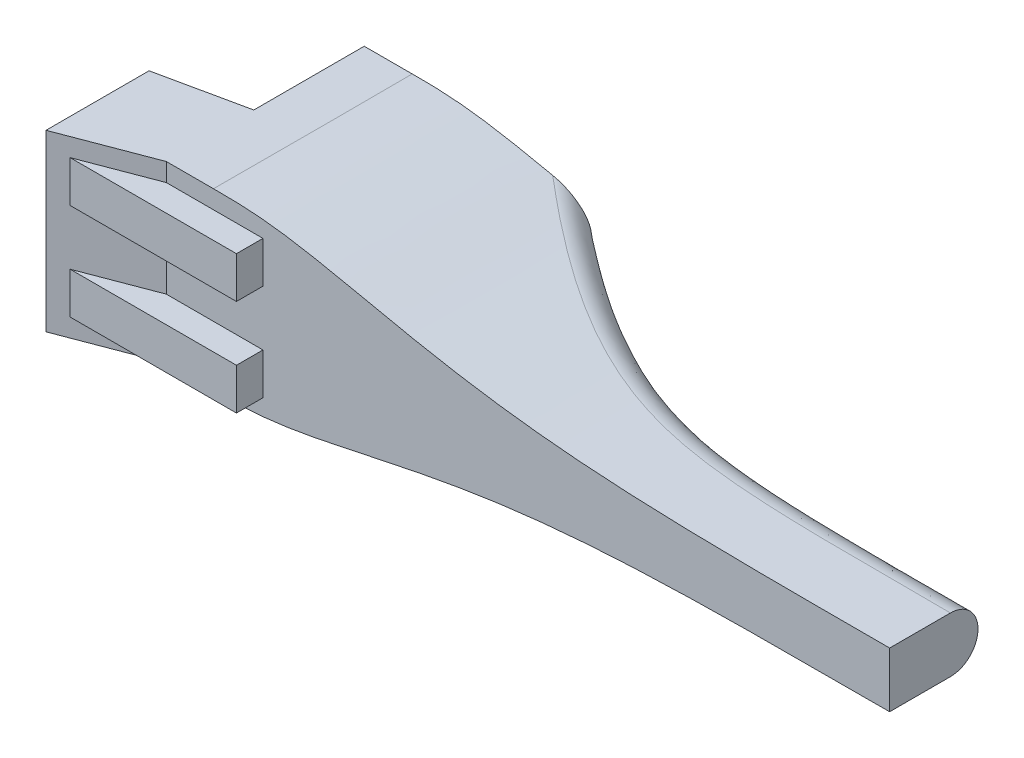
ISO-10303-21;
HEADER;
FILE_DESCRIPTION(('STEP AP214'),'2;1');
FILE_NAME('part.step','',(''),(''),'','','');
FILE_SCHEMA(('AUTOMOTIVE_DESIGN { 1 0 10303 214 1 1 1 1 }'));
ENDSEC;
DATA;
#1=APPLICATION_CONTEXT('core data for automotive mechanical design processes');
#2=APPLICATION_PROTOCOL_DEFINITION('international standard','automotive_design',2000,#1);
#3=PRODUCT_CONTEXT('',#1,'mechanical');
#4=PRODUCT('Part','Part','',(#3));
#5=PRODUCT_RELATED_PRODUCT_CATEGORY('part','',(#4));
#6=PRODUCT_DEFINITION_FORMATION('','',#4);
#7=PRODUCT_DEFINITION_CONTEXT('part definition',#1,'design');
#8=PRODUCT_DEFINITION('design','',#6,#7);
#9=PRODUCT_DEFINITION_SHAPE('','',#8);
#10=(LENGTH_UNIT() NAMED_UNIT(*) SI_UNIT(.MILLI.,.METRE.));
#11=(NAMED_UNIT(*) PLANE_ANGLE_UNIT() SI_UNIT($,.RADIAN.));
#12=(NAMED_UNIT(*) SI_UNIT($,.STERADIAN.) SOLID_ANGLE_UNIT());
#13=UNCERTAINTY_MEASURE_WITH_UNIT(LENGTH_MEASURE(1.E-05),#10,'distance_accuracy_value','');
#14=(GEOMETRIC_REPRESENTATION_CONTEXT(3) GLOBAL_UNCERTAINTY_ASSIGNED_CONTEXT((#13)) GLOBAL_UNIT_ASSIGNED_CONTEXT((#10,
#11,#12)) REPRESENTATION_CONTEXT('',''));
#15=CARTESIAN_POINT('',(0.,0.,0.));
#16=DIRECTION('',(0.,0.,1.));
#17=DIRECTION('',(1.,0.,0.));
#18=AXIS2_PLACEMENT_3D('',#15,#16,#17);
#19=CARTESIAN_POINT('',(4016.53090073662,-99993.6181304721,200.));
#20=CARTESIAN_POINT('',(4013.2247205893,-99993.6181304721,200.));
#21=CARTESIAN_POINT('',(4009.91854044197,-99993.6181304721,200.));
#22=CARTESIAN_POINT('',(4006.61236029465,-99993.6181304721,200.));
#23=CARTESIAN_POINT('',(4003.30618014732,-99993.6181304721,200.));
#24=CARTESIAN_POINT('',(4000.,-99993.6181304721,200.));
#25=CARTESIAN_POINT('',(3539.926208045,-99993.6181304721,200.));
#26=CARTESIAN_POINT('',(3432.615827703,-99993.6181304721,200.));
#27=CARTESIAN_POINT('',(3304.179337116,-99993.6181304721,200.));
#28=CARTESIAN_POINT('',(3111.275940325,-99993.6181304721,90.4822600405));
#29=CARTESIAN_POINT('',(2949.981570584,-99993.6181304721,-39.13259545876));
#30=CARTESIAN_POINT('',(2925.832981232,-99993.6181304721,-59.24608140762));
#31=CARTESIAN_POINT('',(2860.468580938,-99993.6181304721,-114.6760196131));
#32=CARTESIAN_POINT('',(2795.104180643,-99993.6181304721,-170.1059578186));
#33=CARTESIAN_POINT('',(2753.642476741,-99993.6181304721,-205.266070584));
#34=CARTESIAN_POINT('',(2712.180772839,-99993.6181304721,-240.4261833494));
#35=CARTESIAN_POINT('',(2670.719068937,-99993.6181304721,-275.5862961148));
#36=(BOUNDED_CURVE() B_SPLINE_CURVE(5,(#19,#20,#21,#22,#23,#24,#25,#26,#27,#28,#29,#30,#31,#32,
#33,#34,#35),.UNSPECIFIED.,.F.,.F.) B_SPLINE_CURVE_WITH_KNOTS((6,5,3,3,6),(-0.00481299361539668,
0.,0.669755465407,0.790520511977,1.),
.UNSPECIFIED.) CURVE() GEOMETRIC_REPRESENTATION_ITEM() RATIONAL_B_SPLINE_CURVE((1.,1.,1.,1.,1.,
1.,1.,1.,1.,1.,1.,1.,1.,1.,1.,1.,1.)) REPRESENTATION_ITEM(''));
#37=DIRECTION('',(0.,1.,0.));
#38=VECTOR('',#37,1.);
#39=SURFACE_OF_LINEAR_EXTRUSION('',#36,#38);
#40=CARTESIAN_POINT('',(3000.00000000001,66.5195283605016,-2.04238840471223E-11));
#41=CARTESIAN_POINT('',(3004.22332573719,65.5941775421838,3.21712809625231));
#42=CARTESIAN_POINT('',(3008.46353740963,64.6716149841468,6.41285609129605));
#43=CARTESIAN_POINT('',(3016.71438124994,62.8881716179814,12.5619960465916));
#44=CARTESIAN_POINT('',(3020.7229229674,62.0270173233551,15.5181342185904));
#45=CARTESIAN_POINT('',(3031.97182761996,59.6242393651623,23.7227872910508));
#46=CARTESIAN_POINT('',(3039.24706609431,58.0861161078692,28.924680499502));
#47=CARTESIAN_POINT('',(3052.77020501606,55.2561404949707,38.38788691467));
#48=CARTESIAN_POINT('',(3059.00307471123,53.9629720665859,42.6702985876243));
#49=CARTESIAN_POINT('',(3070.39828220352,51.6230680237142,50.3474833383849));
#50=CARTESIAN_POINT('',(3075.54753345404,50.5745910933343,53.761133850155));
#51=CARTESIAN_POINT('',(3082.88030782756,49.1016687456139,58.5400350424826));
#52=CARTESIAN_POINT('',(3085.04100777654,48.6701074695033,59.9381794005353));
#53=CARTESIAN_POINT('',(3088.18167145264,48.047876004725,61.9556160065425));
#54=CARTESIAN_POINT('',(3089.15765938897,47.8552178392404,62.58048487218));
#55=CARTESIAN_POINT('',(3091.03998514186,47.4855063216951,63.7816124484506));
#56=CARTESIAN_POINT('',(3091.94617441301,47.3083459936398,64.3580710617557));
#57=CARTESIAN_POINT('',(3094.57577455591,46.7961648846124,66.025624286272));
#58=CARTESIAN_POINT('',(3096.30148555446,46.4624085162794,67.1134828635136));
#59=CARTESIAN_POINT('',(3099.74617312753,45.7995857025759,69.2718110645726));
#60=CARTESIAN_POINT('',(3101.46510318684,45.4705028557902,70.3423499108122));
#61=CARTESIAN_POINT('',(3106.59163902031,44.4945603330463,73.5155175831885));
#62=CARTESIAN_POINT('',(3110.00830736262,43.8513527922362,75.6046347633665));
#63=CARTESIAN_POINT('',(3120.13297740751,41.9667373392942,81.7171649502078));
#64=CARTESIAN_POINT('',(3126.8758085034,40.7391701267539,85.6873936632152));
#65=CARTESIAN_POINT('',(3140.23590840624,38.3643842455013,93.3439025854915));
#66=CARTESIAN_POINT('',(3146.85005383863,37.2158508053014,97.0352240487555));
#67=CARTESIAN_POINT('',(3159.94595821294,34.9992726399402,104.137443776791));
#68=CARTESIAN_POINT('',(3166.42462067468,33.9298193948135,107.553604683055));
#69=CARTESIAN_POINT('',(3179.24581057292,31.8712634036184,114.11194228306));
#70=CARTESIAN_POINT('',(3185.58534046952,30.8806618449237,117.259503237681));
#71=CARTESIAN_POINT('',(3198.51817782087,28.9217316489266,123.47736321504));
#72=CARTESIAN_POINT('',(3205.11374758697,27.9546986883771,126.543372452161));
#73=CARTESIAN_POINT('',(3218.40028634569,26.0712126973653,132.498854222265));
#74=CARTESIAN_POINT('',(3225.09135310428,25.1548170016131,135.388127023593));
#75=CARTESIAN_POINT('',(3238.5734138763,23.3723080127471,140.979740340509));
#76=CARTESIAN_POINT('',(3245.36457749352,22.5062963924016,143.681704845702));
#77=CARTESIAN_POINT('',(3259.0557492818,20.8245619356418,148.89044859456));
#78=CARTESIAN_POINT('',(3265.95605961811,20.009029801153,151.396496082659));
#79=CARTESIAN_POINT('',(3279.87963990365,18.4281235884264,156.207473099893));
#80=CARTESIAN_POINT('',(3286.90340193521,17.6630839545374,158.511089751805));
#81=CARTESIAN_POINT('',(3301.0941503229,16.1829983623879,162.913768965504));
#82=CARTESIAN_POINT('',(3308.26186369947,15.4684983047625,165.01067298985));
#83=CARTESIAN_POINT('',(3322.76800217,14.0892541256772,168.999122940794));
#84=CARTESIAN_POINT('',(3330.10741181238,13.4253478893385,170.887378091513));
#85=CARTESIAN_POINT('',(3344.99275717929,12.1469593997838,174.460447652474));
#86=CARTESIAN_POINT('',(3352.53992448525,11.5336979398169,176.140560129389));
#87=CARTESIAN_POINT('',(3367.88650369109,10.3562258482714,179.301993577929));
#88=CARTESIAN_POINT('',(3375.68735293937,9.7937160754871,180.776971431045));
#89=CARTESIAN_POINT('',(3387.51669336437,8.99321877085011,182.82797867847));
#90=CARTESIAN_POINT('',(3391.52863145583,8.73080742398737,183.491474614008));
#91=CARTESIAN_POINT('',(3399.63797303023,8.21848816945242,184.770864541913));
#92=CARTESIAN_POINT('',(3403.73557403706,7.96890505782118,185.385638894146));
#93=CARTESIAN_POINT('',(3413.91644363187,7.37006369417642,186.838639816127));
#94=CARTESIAN_POINT('',(3420.00530734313,7.03071213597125,187.641832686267));
#95=CARTESIAN_POINT('',(3432.40444961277,6.37481385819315,189.155806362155));
#96=CARTESIAN_POINT('',(3438.71527686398,6.05942055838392,189.862562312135));
#97=CARTESIAN_POINT('',(3451.5927015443,5.45161482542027,191.188787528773));
#98=CARTESIAN_POINT('',(3458.159812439,5.16055042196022,191.803861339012));
#99=CARTESIAN_POINT('',(3471.58847736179,4.6011247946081,192.9522912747));
#100=CARTESIAN_POINT('',(3478.45049134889,4.33428827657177,193.480967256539));
#101=CARTESIAN_POINT('',(3492.51240265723,3.8231718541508,194.462568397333));
#102=CARTESIAN_POINT('',(3499.71269695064,3.58059116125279,194.91063497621));
#103=CARTESIAN_POINT('',(3514.49972080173,3.11781520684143,195.737302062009));
#104=CARTESIAN_POINT('',(3522.08677931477,2.89947837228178,196.110985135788));
#105=CARTESIAN_POINT('',(3537.70139641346,2.48504186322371,196.795416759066));
#106=CARTESIAN_POINT('',(3545.72921666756,2.29094076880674,197.101315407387));
#107=CARTESIAN_POINT('',(3562.28534543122,1.92486169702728,197.6568669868));
#108=CARTESIAN_POINT('',(3570.81385319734,1.75499886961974,197.901862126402));
#109=CARTESIAN_POINT('',(3588.43771905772,1.43724668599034,198.342416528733));
#110=CARTESIAN_POINT('',(3597.53322266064,1.29155672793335,198.533628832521));
#111=CARTESIAN_POINT('',(3611.41211374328,1.09309909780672,198.783960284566));
#112=CARTESIAN_POINT('',(3616.1950082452,1.02902868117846,198.862720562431));
#113=CARTESIAN_POINT('',(3625.93053370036,0.906434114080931,199.009903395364));
#114=CARTESIAN_POINT('',(3630.88317526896,0.848186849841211,199.077860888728));
#115=CARTESIAN_POINT('',(3638.30688345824,0.767301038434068,199.170937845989));
#116=CARTESIAN_POINT('',(3640.77786184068,0.74144484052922,199.2004593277));
#117=CARTESIAN_POINT('',(3645.82686767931,0.69106125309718,199.258031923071));
#118=CARTESIAN_POINT('',(3648.40489755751,0.666639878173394,199.285964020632));
#119=CARTESIAN_POINT('',(3656.47775069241,0.593620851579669,199.369237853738));
#120=CARTESIAN_POINT('',(3661.97265851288,0.548930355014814,199.419836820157));
#121=CARTESIAN_POINT('',(3673.44665826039,0.46409815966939,199.515011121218));
#122=CARTESIAN_POINT('',(3679.42576312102,0.42470393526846,199.558663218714));
#123=CARTESIAN_POINT('',(3691.91156011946,0.350501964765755,199.639751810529));
#124=CARTESIAN_POINT('',(3698.41826208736,0.316405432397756,199.676300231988));
#125=CARTESIAN_POINT('',(3719.72382870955,0.216589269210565,199.781436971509));
#126=CARTESIAN_POINT('',(3734.52285357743,0.165944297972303,199.831499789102));
#127=CARTESIAN_POINT('',(3757.73230678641,0.104988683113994,199.889761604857));
#128=CARTESIAN_POINT('',(3766.14270209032,0.0867041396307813,199.906703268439));
#129=CARTESIAN_POINT('',(3783.72890851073,0.0548736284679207,199.935816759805));
#130=CARTESIAN_POINT('',(3792.90472175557,0.0419103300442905,199.94741419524));
#131=CARTESIAN_POINT('',(3812.10126795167,0.020696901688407,199.966742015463));
#132=CARTESIAN_POINT('',(3822.12200182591,0.0129906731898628,199.974017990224));
#133=CARTESIAN_POINT('',(3843.09782081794,0.00242634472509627,199.985448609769));
#134=CARTESIAN_POINT('',(3854.05290642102,8.7287919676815E-05,199.989248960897));
#135=CARTESIAN_POINT('',(3865.00799077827,1.57795909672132E-06,199.992183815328));
#136=B_SPLINE_CURVE_WITH_KNOTS('',3,(#40,#41,#42,#43,#44,#45,#46,#47,#48,#49,#50,#51,#52,#53,
#54,#55,#56,#57,#58,#59,#60,#61,#62,#63,#64,#65,#66,#67,#68,#69,#70,#71,#72,#73,#74,#75,#76,#77,
#78,#79,#80,#81,#82,#83,#84,#85,#86,#87,#88,#89,#90,#91,#92,#93,#94,#95,#96,#97,#98,#99,#100,
#101,#102,#103,#104,#105,#106,#107,#108,#109,#110,#111,#112,#113,#114,#115,#116,#117,#118,#119,
#120,#121,#122,#123,#124,#125,#126,#127,#128,#129,#130,#131,#132,#133,#134,#135),.UNSPECIFIED.,
.F.,.F.,(4,2,2,2,2,2,2,2,2,2,2,2,2,2,2,2,2,2,2,2,2,2,2,2,2,2,2,2,2,2,2,2,2,2,2,2,2,2,2,2,2,2,2,
2,2,2,2,4),(0.,16.16724777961,31.3307629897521,58.5537295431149,81.5686810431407,
100.366934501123,108.195490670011,111.719853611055,114.985400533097,121.186670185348,
127.341445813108,139.509455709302,163.268901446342,186.249967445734,208.453188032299,
229.891615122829,251.900963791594,273.934742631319,296.011543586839,318.16721100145,
340.45733998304,362.959886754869,385.777875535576,409.042200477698,432.914548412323,
445.138816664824,457.59125082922,476.042749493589,495.115861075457,514.921581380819,
535.583211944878,557.237330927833,580.034877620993,604.142352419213,629.743129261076,
657.038873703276,671.390772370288,686.251095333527,693.664963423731,701.399851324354,
717.885798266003,735.823964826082,755.344634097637,799.742132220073,824.973428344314,
852.500911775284,882.5631282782,915.428384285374),.UNSPECIFIED.);
#137=CARTESIAN_POINT('',(3000.,66.51952836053,0.));
#138=VERTEX_POINT('',#137);
#139=CARTESIAN_POINT('',(3865.00799077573,1.57796490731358E-06,199.99219279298));
#140=VERTEX_POINT('',#139);
#141=EDGE_CURVE('E11',#138,#140,#136,.T.);
#142=ORIENTED_EDGE('',*,*,#141,.T.);
#143=CARTESIAN_POINT('',(2949.80052363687,-77.5345254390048,-39.6944839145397));
#144=CARTESIAN_POINT('',(2966.50411068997,-73.901301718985,-26.0621913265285));
#145=CARTESIAN_POINT('',(2983.24686926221,-70.1904998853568,-12.7586034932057));
#146=CARTESIAN_POINT('',(3018.39698839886,-62.4892031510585,14.0105368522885));
#147=CARTESIAN_POINT('',(3036.87903647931,-58.4998761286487,27.4465758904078));
#148=CARTESIAN_POINT('',(3093.19331561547,-46.8336659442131,66.1464004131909));
#149=CARTESIAN_POINT('',(3131.87350558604,-39.4779585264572,89.8323626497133));
#150=CARTESIAN_POINT('',(3182.30411116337,-31.3767053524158,115.687686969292));
#151=CARTESIAN_POINT('',(3192.49573378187,-29.8095740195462,120.668909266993));
#152=CARTESIAN_POINT('',(3213.11548786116,-26.7899866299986,130.216226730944));
#153=CARTESIAN_POINT('',(3223.51734847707,-25.3418307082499,134.768403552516));
#154=CARTESIAN_POINT('',(3254.76081919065,-21.2223093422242,147.616046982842));
#155=CARTESIAN_POINT('',(3275.73503102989,-18.7623314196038,155.14326733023));
#156=CARTESIAN_POINT('',(3318.13566245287,-14.3981021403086,168.089090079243));
#157=CARTESIAN_POINT('',(3339.56573178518,-12.4935341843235,173.505531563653));
#158=CARTESIAN_POINT('',(3383.11904247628,-9.19229699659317,182.400059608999));
#159=CARTESIAN_POINT('',(3405.25019326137,-7.79541055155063,185.879293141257));
#160=CARTESIAN_POINT('',(3450.33713852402,-5.4394620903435,191.303282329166));
#161=CARTESIAN_POINT('',(3473.29256664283,-4.48009596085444,193.253977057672));
#162=CARTESIAN_POINT('',(3519.89016375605,-2.91398141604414,196.153923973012));
#163=CARTESIAN_POINT('',(3543.51099996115,-2.30763258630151,197.107390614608));
#164=CARTESIAN_POINT('',(3590.95969554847,-1.36024108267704,198.472656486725));
#165=CARTESIAN_POINT('',(3614.82254160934,-1.01770956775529,198.886797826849));
#166=CARTESIAN_POINT('',(3662.69404396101,-0.510449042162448,199.465051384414));
#167=CARTESIAN_POINT('',(3686.70285354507,-0.345737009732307,199.626985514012));
#168=CARTESIAN_POINT('',(3758.83176879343,-0.0136169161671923,199.953826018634));
#169=CARTESIAN_POINT('',(3807.0463004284,-0.00248061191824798,199.97379278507));
#170=CARTESIAN_POINT('',(3870.23563164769,-5.85166423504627E-05,199.994224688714));
#171=CARTESIAN_POINT('',(3885.19899306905,0.000178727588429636,199.997082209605));
#172=CARTESIAN_POINT('',(3900.1637305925,0.000233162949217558,199.998722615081));
#173=(BOUNDED_CURVE() B_SPLINE_CURVE(3,(#143,#144,#145,#146,#147,#148,#149,#150,#151,#152,#153,
#154,#155,#156,#157,#158,#159,#160,#161,#162,#163,#164,#165,#166,#167,#168,#169,#170,#171,#172),
.UNSPECIFIED.,.F.,.F.) B_SPLINE_CURVE_WITH_KNOTS((4,2,2,2,2,2,2,2,2,2,2,2,2,2,4),
(0.0862230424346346,0.144088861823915,0.206588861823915,0.331588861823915,0.362838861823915,
0.394088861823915,0.456588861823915,0.519088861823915,0.581588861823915,0.644088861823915,
0.706588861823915,0.769088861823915,0.831588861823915,0.956588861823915,0.99536581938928),
.UNSPECIFIED.) CURVE() GEOMETRIC_REPRESENTATION_ITEM() RATIONAL_B_SPLINE_CURVE((0.999996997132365,
0.999996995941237,0.999996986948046,0.999996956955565,0.999996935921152,0.999996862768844,
0.999996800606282,0.999996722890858,0.999996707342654,0.99999667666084,0.999996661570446,
0.999996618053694,0.999996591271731,0.999996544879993,0.999996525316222,0.999996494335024,
0.999996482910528,0.999996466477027,0.999996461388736,0.999996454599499,0.999996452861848,
0.999996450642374,0.999996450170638,0.999996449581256,0.999996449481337,0.999996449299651,
0.999996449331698,0.999996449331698,0.999996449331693,0.999996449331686)) REPRESENTATION_ITEM(''));
#174=CARTESIAN_POINT('',(3000.,-66.51952836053,0.));
#175=VERTEX_POINT('',#174);
#176=EDGE_CURVE('E185',#175,#140,#173,.T.);
#177=ORIENTED_EDGE('',*,*,#176,.F.);
#178=DIRECTION('',(0.,1.,0.));
#179=VECTOR('',#178,1.);
#180=CARTESIAN_POINT('',(3000.,0.,0.));
#181=LINE('',#180,#179);
#182=EDGE_CURVE('E62',#175,#138,#181,.T.);
#183=ORIENTED_EDGE('',*,*,#182,.T.);
#184=EDGE_LOOP('',(#142,#177,#183));
#185=FACE_BOUND('',#184,.T.);
#186=ADVANCED_FACE('F46',(#185),#39,.T.);
#187=CARTESIAN_POINT('',(3900.16377340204,-0.908500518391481,199.998722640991));
#188=CARTESIAN_POINT('',(3900.16375200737,-0.454581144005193,199.998722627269));
#189=CARTESIAN_POINT('',(3900.1637306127,-0.000661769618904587,199.998722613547));
#190=CARTESIAN_POINT('',(3900.16137387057,49.9993399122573,199.998721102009));
#191=CARTESIAN_POINT('',(3900.15706407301,49.9993383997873,249.998723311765));
#192=CARTESIAN_POINT('',(3885.19904060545,-0.908446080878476,199.997082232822));
#193=CARTESIAN_POINT('',(3885.19901684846,-0.454526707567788,199.997082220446));
#194=CARTESIAN_POINT('',(3885.19899309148,-0.000607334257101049,199.99708220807));
#195=CARTESIAN_POINT('',(3885.1963761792,49.9993941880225,199.997080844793));
#196=CARTESIAN_POINT('',(3885.18976064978,49.9993928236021,249.997082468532));
#197=CARTESIAN_POINT('',(3870.23566256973,-0.908208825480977,199.994224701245));
#198=CARTESIAN_POINT('',(3870.23564711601,-0.454289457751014,199.99422469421));
#199=CARTESIAN_POINT('',(3870.23563166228,-0.000370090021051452,199.994224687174));
#200=CARTESIAN_POINT('',(3870.233929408,49.9996307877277,199.994223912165));
#201=CARTESIAN_POINT('',(3870.22364070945,49.9996300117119,249.99422397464));
#202=CARTESIAN_POINT('',(3807.04605376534,-0.905786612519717,199.973792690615));
#203=CARTESIAN_POINT('',(3807.04617703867,-0.451867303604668,199.973792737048));
#204=CARTESIAN_POINT('',(3807.046300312,0.002052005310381,199.97379278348));
#205=CARTESIAN_POINT('',(3807.059879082,50.002046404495,199.9737978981));
#206=CARTESIAN_POINT('',(3807.024762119,50.002051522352,249.97378404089));
#207=CARTESIAN_POINT('',(3758.8303289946,-0.894656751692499,199.953832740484));
#208=CARTESIAN_POINT('',(3758.8310485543,-0.440734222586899,199.953829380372));
#209=CARTESIAN_POINT('',(3758.831768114,0.0131883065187,199.95382602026));
#210=CARTESIAN_POINT('',(3758.911029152,50.013724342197,199.95345589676));
#211=CARTESIAN_POINT('',(3758.842685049,50.013354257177,249.95403276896));
#212=CARTESIAN_POINT('',(3686.69731188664,-0.562498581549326,199.626953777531));
#213=CARTESIAN_POINT('',(3686.70008140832,-0.108595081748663,199.62696963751));
#214=CARTESIAN_POINT('',(3686.70285093,0.345308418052,199.62698549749));
#215=CARTESIAN_POINT('',(3687.007913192,50.342688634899,199.6287324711));
#216=CARTESIAN_POINT('',(3686.701744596,50.344435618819,249.6261121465));
#217=CARTESIAN_POINT('',(3662.68672660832,-0.397765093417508,199.464998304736));
#218=CARTESIAN_POINT('',(3662.69038355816,0.0561276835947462,199.465024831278));
#219=CARTESIAN_POINT('',(3662.694040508,0.510020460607,199.46505135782));
#220=CARTESIAN_POINT('',(3663.09684811,50.505636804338,199.4679732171));
#221=CARTESIAN_POINT('',(3662.6770052,50.508557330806,249.46363711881));
#222=CARTESIAN_POINT('',(3614.81073311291,0.109605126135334,198.886619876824));
#223=CARTESIAN_POINT('',(3614.81663457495,0.563443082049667,198.886708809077));
#224=CARTESIAN_POINT('',(3614.822536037,1.017281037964,198.88679774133));
#225=CARTESIAN_POINT('',(3615.472528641,51.003422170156,198.8965928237));
#226=CARTESIAN_POINT('',(3614.683180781,51.01321627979,248.88091732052));
#227=CARTESIAN_POINT('',(3590.94511708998,0.452223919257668,198.472377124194));
#228=CARTESIAN_POINT('',(3590.95240287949,0.906018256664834,198.472516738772));
#229=CARTESIAN_POINT('',(3590.959688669,1.359812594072,198.47265635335));
#230=CARTESIAN_POINT('',(3591.762108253,51.338399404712,198.48803278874));
#231=CARTESIAN_POINT('',(3590.714117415,51.353747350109,248.4632712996));
#232=CARTESIAN_POINT('',(3543.48983379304,1.3999803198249,197.106641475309));
#233=CARTESIAN_POINT('',(3543.50041188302,1.85359229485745,197.107015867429));
#234=CARTESIAN_POINT('',(3543.510989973,2.30720426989,197.10739025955));
#235=CARTESIAN_POINT('',(3544.675705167,52.252776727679,197.14861322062));
#236=CARTESIAN_POINT('',(3542.844172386,52.293985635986,247.07540522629));
#237=CARTESIAN_POINT('',(3519.86501383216,2.00661140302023,196.152797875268));
#238=CARTESIAN_POINT('',(3519.87758286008,2.46008231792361,196.153360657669));
#239=CARTESIAN_POINT('',(3519.890151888,2.913553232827,196.15392344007));
#240=CARTESIAN_POINT('',(3521.273801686,52.833478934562,196.21587681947));
#241=CARTESIAN_POINT('',(3518.904598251,52.895174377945,246.10354197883));
#242=CARTESIAN_POINT('',(3473.25853162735,3.57373833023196,193.25141984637));
#243=CARTESIAN_POINT('',(3473.27554110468,4.02670329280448,193.252697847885));
#244=CARTESIAN_POINT('',(3473.292550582,4.479668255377,193.2539758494));
#245=CARTESIAN_POINT('',(3475.163542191,54.304458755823,193.39455219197));
#246=CARTESIAN_POINT('',(3471.322241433,54.445041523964,243.11126548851));
#247=CARTESIAN_POINT('',(3450.29786245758,4.53385828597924,191.299615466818));
#248=CARTESIAN_POINT('',(3450.31749122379,4.98644651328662,191.301448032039));
#249=CARTESIAN_POINT('',(3450.33711999,5.439034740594,191.30328059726));
#250=CARTESIAN_POINT('',(3452.494946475,55.192893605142,191.50473787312));
#251=CARTESIAN_POINT('',(3447.695649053,55.393314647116,241.08598542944));
#252=CARTESIAN_POINT('',(3405.2001024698,6.8921101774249,185.872209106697));
#253=CARTESIAN_POINT('',(3405.2251360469,7.34354723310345,185.875749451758));
#254=CARTESIAN_POINT('',(3405.250169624,7.794984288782,185.87928979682));
#255=CARTESIAN_POINT('',(3407.996901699,57.327523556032,186.26774324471));
#256=CARTESIAN_POINT('',(3400.909315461,57.717539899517,235.3807329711));
#257=CARTESIAN_POINT('',(3383.06283811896,8.29060407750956,182.39051385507));
#258=CARTESIAN_POINT('',(3383.09092703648,8.74123778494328,182.395284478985));
#259=CARTESIAN_POINT('',(3383.119015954,9.191871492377,182.4000551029));
#260=CARTESIAN_POINT('',(3386.19689977,58.570712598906,182.92280312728));
#261=CARTESIAN_POINT('',(3377.751649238,59.093759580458,231.69172937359));
#262=CARTESIAN_POINT('',(3339.49793164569,11.596055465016,173.489752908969));
#263=CARTESIAN_POINT('',(3339.53181571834,12.044583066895,173.49763851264));
#264=CARTESIAN_POINT('',(3339.565699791,12.493110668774,173.50552411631));
#265=CARTESIAN_POINT('',(3343.265294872,61.465101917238,174.36650505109));
#266=CARTESIAN_POINT('',(3332.002649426,62.340364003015,222.1915666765));
#267=CARTESIAN_POINT('',(3318.06174710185,13.5033181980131,168.069272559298));
#268=CARTESIAN_POINT('',(3318.09868733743,13.9504990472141,168.079176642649));
#269=CARTESIAN_POINT('',(3318.135627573,14.397679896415,168.089080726));
#270=CARTESIAN_POINT('',(3322.159802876,63.1124241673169,169.16800637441));
#271=CARTESIAN_POINT('',(3309.411669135,64.210908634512,216.3790139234));
#272=CARTESIAN_POINT('',(3275.65029100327,17.8738096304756,155.114643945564));
#273=CARTESIAN_POINT('',(3275.69264102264,18.3178608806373,155.128948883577));
#274=CARTESIAN_POINT('',(3275.734991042,18.761912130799,155.14325382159));
#275=CARTESIAN_POINT('',(3280.323933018,66.8781928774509,156.69330105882));
#276=CARTESIAN_POINT('',(3264.810813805,68.491314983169,202.49473084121));
#277=CARTESIAN_POINT('',(3254.67080510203,20.3374651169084,147.58229137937));
#278=CARTESIAN_POINT('',(3254.71579090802,20.7796784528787,147.599161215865));
#279=CARTESIAN_POINT('',(3254.760776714,21.221891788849,147.61603105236));
#280=CARTESIAN_POINT('',(3259.620390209,68.992201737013,149.43840331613));
#281=CARTESIAN_POINT('',(3242.799916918,70.901422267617,194.42785629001));
#282=CARTESIAN_POINT('',(3223.42162449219,24.4627599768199,134.727411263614));
#283=CARTESIAN_POINT('',(3223.4694638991,24.9020879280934,134.747897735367));
#284=CARTESIAN_POINT('',(3223.517303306,25.341415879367,134.76838420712));
#285=CARTESIAN_POINT('',(3228.659577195,72.564924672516,136.97048192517));
#286=CARTESIAN_POINT('',(3210.177289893,74.934883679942,180.7268535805));
#287=CARTESIAN_POINT('',(3213.01766572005,25.9129724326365,130.17262050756));
#288=CARTESIAN_POINT('',(3213.06655371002,26.3512726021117,130.19441332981));
#289=CARTESIAN_POINT('',(3213.1154417,26.789572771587,130.21620615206));
#290=CARTESIAN_POINT('',(3218.361416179,73.82180920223,132.5547066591));
#291=CARTESIAN_POINT('',(3199.342736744,76.352432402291,175.88224179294));
#292=CARTESIAN_POINT('',(3192.39408929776,28.9367347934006,120.620158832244));
#293=CARTESIAN_POINT('',(3192.44488755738,29.3729484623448,120.644522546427));
#294=CARTESIAN_POINT('',(3192.495685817,29.809162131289,120.66888626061));
#295=CARTESIAN_POINT('',(3197.927703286,76.454859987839,123.27417474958));
#296=CARTESIAN_POINT('',(3177.918029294,79.308087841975,165.74763420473));
#297=CARTESIAN_POINT('',(3182.20073426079,30.5059898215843,115.636374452));
#298=CARTESIAN_POINT('',(3182.25239832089,30.9411421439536,115.662018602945));
#299=CARTESIAN_POINT('',(3182.304062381,31.376294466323,115.68766275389));
#300=CARTESIAN_POINT('',(3187.818951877,77.826708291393,118.42505231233));
#301=CARTESIAN_POINT('',(3167.354897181,80.841988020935,160.47235447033));
#302=CARTESIAN_POINT('',(3131.75736578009,38.6186480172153,89.7660671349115));
#303=CARTESIAN_POINT('',(3131.81540828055,39.0481005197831,89.7991992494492));
#304=CARTESIAN_POINT('',(3131.873450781,39.477553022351,89.832331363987));
#305=CARTESIAN_POINT('',(3138.015247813,84.920290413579,93.338223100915));
#306=CARTESIAN_POINT('',(3115.199077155,88.773313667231,133.15960873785));
#307=CARTESIAN_POINT('',(3093.07524642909,45.9828430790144,66.0712479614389));
#308=CARTESIAN_POINT('',(3093.13425316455,46.4080537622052,66.1088064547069));
#309=CARTESIAN_POINT('',(3093.1932599,46.833264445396,66.146364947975));
#310=CARTESIAN_POINT('',(3099.393892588,91.515879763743,70.093141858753));
#311=CARTESIAN_POINT('',(3075.562360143,95.978376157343,108.35994167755));
#312=CARTESIAN_POINT('',(3036.76347022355,57.6581460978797,27.3641643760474));
#313=CARTESIAN_POINT('',(3036.82122608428,58.0788125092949,27.4053506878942));
#314=CARTESIAN_POINT('',(3036.878981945,58.49947892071,27.446536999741));
#315=CARTESIAN_POINT('',(3042.899157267,102.34759263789,31.739587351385));
#316=CARTESIAN_POINT('',(3017.882334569,107.47911037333,68.15121243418));
#317=CARTESIAN_POINT('',(3018.28242964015,61.6501124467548,13.9259227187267));
#318=CARTESIAN_POINT('',(3018.33968199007,62.0694598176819,13.9682098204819));
#319=CARTESIAN_POINT('',(3018.39693434,62.488807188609,14.010496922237));
#320=CARTESIAN_POINT('',(3024.350801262,106.09816896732,18.408076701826));
#321=CARTESIAN_POINT('',(2998.956793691,111.42392860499,54.236834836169));
#322=CARTESIAN_POINT('',(2983.13521989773,69.3549666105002,-12.8460668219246));
#323=CARTESIAN_POINT('',(2983.19101823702,69.7725361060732,-12.8023557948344));
#324=CARTESIAN_POINT('',(2983.2468165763,70.1901056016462,-12.7586447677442));
#325=CARTESIAN_POINT('',(2989.03037146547,113.471610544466,-8.2279521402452));
#326=CARTESIAN_POINT('',(2962.89738769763,119.077623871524,26.6044088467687));
#327=CARTESIAN_POINT('',(2966.39480674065,73.0665829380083,-26.1498672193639));
#328=CARTESIAN_POINT('',(2966.44943292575,73.4837453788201,-26.1060499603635));
#329=CARTESIAN_POINT('',(2966.50405911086,73.900907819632,-26.0622327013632));
#330=CARTESIAN_POINT('',(2972.16053488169,117.097576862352,-21.5250082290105));
#331=CARTESIAN_POINT('',(2945.7373896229,122.782729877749,12.944932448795));
#332=CARTESIAN_POINT('',(2949.6936432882,76.699594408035,-39.7817148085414));
#333=CARTESIAN_POINT('',(2949.74705824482,77.1168629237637,-39.7381199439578));
#334=CARTESIAN_POINT('',(2949.80047320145,77.5341314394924,-39.6945250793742));
#335=CARTESIAN_POINT('',(2955.33080532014,120.736141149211,-35.1809188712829));
#336=CARTESIAN_POINT('',(2928.61519294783,126.434260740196,-0.958412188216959));
#337=(BOUNDED_SURFACE() B_SPLINE_SURFACE(3,2,((#187,#188,#189,#190,#191),(#192,#193,#194,#195,
#196),(#197,#198,#199,#200,#201),(#202,#203,#204,#205,#206),(#207,#208,#209,#210,#211),(#212,
#213,#214,#215,#216),(#217,#218,#219,#220,#221),(#222,#223,#224,#225,#226),(#227,#228,#229,#230,
#231),(#232,#233,#234,#235,#236),(#237,#238,#239,#240,#241),(#242,#243,#244,#245,#246),(#247,
#248,#249,#250,#251),(#252,#253,#254,#255,#256),(#257,#258,#259,#260,#261),(#262,#263,#264,#265,
#266),(#267,#268,#269,#270,#271),(#272,#273,#274,#275,#276),(#277,#278,#279,#280,#281),(#282,
#283,#284,#285,#286),(#287,#288,#289,#290,#291),(#292,#293,#294,#295,#296),(#297,#298,#299,#300,
#301),(#302,#303,#304,#305,#306),(#307,#308,#309,#310,#311),(#312,#313,#314,#315,#316),(#317,
#318,#319,#320,#321),(#322,#323,#324,#325,#326),(#327,#328,#329,#330,#331),(#332,#333,#334,#335,
#336)),.UNSPECIFIED.,.F.,.F.,.F.) B_SPLINE_SURFACE_WITH_KNOTS((4,2,2,2,2,2,2,2,2,2,2,2,2,2,4),
(3,1,1,3),(0.0862230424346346,0.125,0.25,0.3125,0.375,0.4375,0.5,0.5625,0.625,0.6875,0.71875,
0.75,0.875,0.9375,0.99536581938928),(-0.0128387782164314,0.,1.E-06,1.),
.UNSPECIFIED.) GEOMETRIC_REPRESENTATION_ITEM() RATIONAL_B_SPLINE_SURFACE(((1.,1.,1.,
0.707106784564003,1.),(1.,1.,1.,0.707106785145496,1.),(1.,1.,1.,0.707106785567,1.),(1.,1.,1.,
0.707106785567,1.),(1.,1.,1.,0.707104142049,1.),(1.,1.,1.,0.707119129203,1.),(1.,1.,1.,
0.707127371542,1.),(1.,1.,1.,0.707175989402,1.),(1.,1.,1.,0.707214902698,1.),(1.,1.,1.,
0.707397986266,1.),(1.,1.,1.,0.707541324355,1.),(1.,1.,1.,0.708101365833,1.),(1.,1.,1.,
0.708521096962,1.),(1.,1.,1.,0.709876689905,1.),(1.,1.,1.,0.710819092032,1.),(1.,1.,1.,
0.713374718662,1.),(1.,1.,1.,0.714988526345,1.),(1.,1.,1.,0.718815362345,1.),(1.,1.,1.,
0.721024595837,1.),(1.,1.,1.,0.724614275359,1.),(1.,1.,1.,0.725859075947,1.),(1.,1.,1.,
0.728390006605,1.),(1.,1.,1.,0.729672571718,1.),(1.,1.,1.,0.736083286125,1.),(1.,1.,1.,
0.741211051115,1.),(1.,1.,1.,0.747245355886,1.),(1.,1.,1.,0.748980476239,1.),(1.,1.,1.,
0.751454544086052,1.),(1.,1.,1.,0.752196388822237,1.),(1.,1.,1.,0.752294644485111,1.))) REPRESENTATION_ITEM('') SURFACE());
#338=CARTESIAN_POINT('',(3000.00000004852,66.51952836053,-6.36887681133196E-08));
#339=CARTESIAN_POINT('',(2999.99985575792,67.0081578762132,-0.000125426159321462));
#340=CARTESIAN_POINT('',(2999.98812389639,67.4967502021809,-0.000302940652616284));
#341=CARTESIAN_POINT('',(2999.94189107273,68.4794157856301,-0.000681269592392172));
#342=CARTESIAN_POINT('',(2999.90708750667,68.9734748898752,-0.000882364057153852));
#343=CARTESIAN_POINT('',(2999.8145069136,69.9664571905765,-0.00122135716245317));
#344=CARTESIAN_POINT('',(2999.75641254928,70.4653506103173,-0.00135832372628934));
#345=CARTESIAN_POINT('',(2999.61707568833,71.4673941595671,-0.00152784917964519));
#346=CARTESIAN_POINT('',(2999.53550413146,71.970498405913,-0.00155883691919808));
#347=CARTESIAN_POINT('',(2999.34905082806,72.9803360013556,-0.00150738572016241));
#348=CARTESIAN_POINT('',(2999.24383091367,73.4870067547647,-0.00142320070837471));
#349=CARTESIAN_POINT('',(2999.0099367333,74.503340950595,-0.00117006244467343));
#350=CARTESIAN_POINT('',(2998.88091769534,75.0129248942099,-0.000999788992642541));
#351=CARTESIAN_POINT('',(2998.59930382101,76.0344396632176,-0.000636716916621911));
#352=CARTESIAN_POINT('',(2998.44635998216,76.5462740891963,-0.000443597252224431));
#353=CARTESIAN_POINT('',(2998.11678062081,77.5716414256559,-0.000145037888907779));
#354=CARTESIAN_POINT('',(2997.93979374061,78.0850613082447,-4.11080105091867E-05));
#355=CARTESIAN_POINT('',(2997.58791124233,79.0426708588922,-2.7379345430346E-05));
#356=CARTESIAN_POINT('',(2997.41535224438,79.4877225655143,-9.56189803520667E-05));
#357=CARTESIAN_POINT('',(2997.05132249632,80.3814162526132,-0.000269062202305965));
#358=CARTESIAN_POINT('',(2996.85952008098,80.8299230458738,-0.000375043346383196));
#359=CARTESIAN_POINT('',(2996.45680861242,81.7300772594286,-0.000574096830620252));
#360=CARTESIAN_POINT('',(2996.24557320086,82.1815784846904,-0.00066683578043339));
#361=CARTESIAN_POINT('',(2995.8038190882,83.0872648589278,-0.00080130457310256));
#362=CARTESIAN_POINT('',(2995.57298025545,83.5412937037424,-0.000841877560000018));
#363=CARTESIAN_POINT('',(2995.09185045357,84.4515608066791,-0.000859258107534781));
#364=CARTESIAN_POINT('',(2994.84124610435,84.9076332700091,-0.000834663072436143));
#365=CARTESIAN_POINT('',(2994.32042931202,85.8214989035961,-0.000731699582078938));
#366=CARTESIAN_POINT('',(2994.04991073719,86.2791174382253,-0.000652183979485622));
#367=CARTESIAN_POINT('',(2993.48912013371,87.1955773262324,-0.000474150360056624));
#368=CARTESIAN_POINT('',(2993.19854954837,87.6542359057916,-0.000375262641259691));
#369=CARTESIAN_POINT('',(2992.59753153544,88.5722536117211,-0.000217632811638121));
#370=CARTESIAN_POINT('',(2992.28679359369,89.0314221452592,-0.00015978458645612));
#371=CARTESIAN_POINT('',(2991.41934373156,90.273532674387,-0.000176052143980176));
#372=CARTESIAN_POINT('',(2990.84924602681,91.0471659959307,-0.000377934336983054));
#373=CARTESIAN_POINT('',(2989.6450171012,92.6036119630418,-0.000713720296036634));
#374=CARTESIAN_POINT('',(2989.00912182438,93.3850542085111,-0.000843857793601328));
#375=CARTESIAN_POINT('',(2987.67193277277,94.9538988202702,-0.000887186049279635));
#376=CARTESIAN_POINT('',(2986.96897195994,95.739878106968,-0.000789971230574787));
#377=CARTESIAN_POINT('',(2985.49648347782,97.3143264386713,-0.000503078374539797));
#378=CARTESIAN_POINT('',(2984.72538418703,98.1013238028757,-0.000309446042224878));
#379=CARTESIAN_POINT('',(2983.25958829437,99.5334501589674,-0.000355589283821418));
#380=CARTESIAN_POINT('',(2982.56924507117,100.183051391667,-0.000538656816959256));
#381=CARTESIAN_POINT('',(2981.1288775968,101.491387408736,-0.000846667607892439));
#382=CARTESIAN_POINT('',(2980.37763077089,102.148775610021,-0.000968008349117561));
#383=CARTESIAN_POINT('',(2978.81416737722,103.469319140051,-0.000998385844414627));
#384=CARTESIAN_POINT('',(2978.00078650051,104.131094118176,-0.00089641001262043));
#385=CARTESIAN_POINT('',(2976.31190816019,105.456842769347,-0.000586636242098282));
#386=CARTESIAN_POINT('',(2975.43530159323,106.119403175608,-0.000374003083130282));
#387=CARTESIAN_POINT('',(2973.79741086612,107.312874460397,-0.000428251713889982));
#388=CARTESIAN_POINT('',(2973.0393679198,107.848246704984,-0.00062577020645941));
#389=CARTESIAN_POINT('',(2971.45411537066,108.934701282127,-0.000931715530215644));
#390=CARTESIAN_POINT('',(2970.62581826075,109.484197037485,-0.00103281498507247));
#391=CARTESIAN_POINT('',(2968.89846056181,110.594439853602,-0.000998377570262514));
#392=CARTESIAN_POINT('',(2967.99833871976,111.153534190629,-0.000846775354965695));
#393=CARTESIAN_POINT('',(2966.12594221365,112.278246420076,-0.000298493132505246));
#394=CARTESIAN_POINT('',(2965.15263610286,112.842148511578,0.000112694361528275));
#395=CARTESIAN_POINT('',(2963.48485459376,113.77421550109,-0.000228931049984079));
#396=CARTESIAN_POINT('',(2962.7947144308,114.150169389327,-0.000668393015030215));
#397=CARTESIAN_POINT('',(2961.26575634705,114.962562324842,-0.00153346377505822));
#398=CARTESIAN_POINT('',(2960.42521983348,115.39577105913,-0.00193811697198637));
#399=CARTESIAN_POINT('',(2958.59195963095,116.312628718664,-0.00206789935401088));
#400=CARTESIAN_POINT('',(2957.59736761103,116.792542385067,-0.00166759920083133));
#401=CARTESIAN_POINT('',(2955.45253255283,117.790743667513,-0.000912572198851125));
#402=CARTESIAN_POINT('',(2954.3002999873,118.304758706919,-0.000572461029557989));
#403=CARTESIAN_POINT('',(2951.94504133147,119.311802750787,0.000234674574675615));
#404=CARTESIAN_POINT('',(2950.74153761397,119.80371429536,0.00070525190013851));
#405=CARTESIAN_POINT('',(2948.49532382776,120.680844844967,0.001689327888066));
#406=CARTESIAN_POINT('',(2947.45461150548,121.071190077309,0.00218670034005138));
#407=CARTESIAN_POINT('',(2945.53921576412,121.760608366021,0.00218136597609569));
#408=CARTESIAN_POINT('',(2944.66607928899,122.06398352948,0.00183293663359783));
#409=CARTESIAN_POINT('',(2943.08949155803,122.59253292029,0.000942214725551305));
#410=CARTESIAN_POINT('',(2942.38719841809,122.821171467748,0.000452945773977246));
#411=CARTESIAN_POINT('',(2940.6894544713,123.357748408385,0.000254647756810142));
#412=CARTESIAN_POINT('',(2939.69209663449,123.659676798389,0.000948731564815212));
#413=CARTESIAN_POINT('',(2937.70107937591,124.235965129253,0.00255136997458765));
#414=CARTESIAN_POINT('',(2936.70749559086,124.510586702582,0.00345753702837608));
#415=CARTESIAN_POINT('',(2934.72505372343,125.032846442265,0.00460809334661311));
#416=CARTESIAN_POINT('',(2933.73626566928,125.280750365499,0.00485971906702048));
#417=CARTESIAN_POINT('',(2931.76441423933,125.750242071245,0.00378335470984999));
#418=CARTESIAN_POINT('',(2930.78141481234,125.972098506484,0.00247340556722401));
#419=CARTESIAN_POINT('',(2929.79594929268,126.182378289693,-6.78381100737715E-05));
#420=B_SPLINE_CURVE_WITH_KNOTS('',3,(#338,#339,#340,#341,#342,#343,#344,#345,#346,#347,#348,
#349,#350,#351,#352,#353,#354,#355,#356,#357,#358,#359,#360,#361,#362,#363,#364,#365,#366,#367,
#368,#369,#370,#371,#372,#373,#374,#375,#376,#377,#378,#379,#380,#381,#382,#383,#384,#385,#386,
#387,#388,#389,#390,#391,#392,#393,#394,#395,#396,#397,#398,#399,#400,#401,#402,#403,#404,#405,
#406,#407,#408,#409,#410,#411,#412,#413,#414,#415,#416,#417,#418,#419),.UNSPECIFIED.,.F.,.F.,(4,
2,2,2,2,2,2,2,2,2,2,2,2,2,2,2,2,2,2,2,2,2,2,2,2,2,2,2,2,2,2,2,2,2,2,2,2,2,2,2,4),(0.,
1.46570307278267,2.95102075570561,4.45730376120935,5.98582302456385,7.53777395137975,
9.11428119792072,10.7164038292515,12.3451407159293,13.776864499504,15.239975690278,
16.7351171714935,18.2628740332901,19.8237781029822,21.4183123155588,23.0469149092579,
24.7099834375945,27.5917403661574,30.6130794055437,33.7753876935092,37.0796338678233,
39.9228003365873,42.9169366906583,46.0620340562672,49.3577919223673,52.1415358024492,
55.1230722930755,58.3014731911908,61.67546646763,64.0330010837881,66.8695272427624,
70.1820623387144,73.9664861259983,77.8662786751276,81.2004115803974,83.9732010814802,
86.1888242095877,89.3146683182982,92.4068853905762,95.464767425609,98.4876613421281),.UNSPECIFIED.);
#421=CARTESIAN_POINT('',(2929.795878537,126.18230585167,0.));
#422=VERTEX_POINT('',#421);
#423=EDGE_CURVE('E176',#422,#138,#420,.F.);
#424=CARTESIAN_POINT('',(3900.00000000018,50.,249.998616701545));
#425=CARTESIAN_POINT('',(3891.6423608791,50.0002631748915,249.997663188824));
#426=CARTESIAN_POINT('',(3883.28472173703,50.0000904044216,249.996383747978));
#427=CARTESIAN_POINT('',(3867.19697680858,49.9999163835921,249.992887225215));
#428=CARTESIAN_POINT('',(3859.46687100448,49.9999032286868,249.990747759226));
#429=CARTESIAN_POINT('',(3844.81811434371,50.0007889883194,249.985506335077));
#430=CARTESIAN_POINT('',(3837.89946344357,50.0015923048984,249.982528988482));
#431=CARTESIAN_POINT('',(3824.83136407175,50.0048491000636,249.975599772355));
#432=CARTESIAN_POINT('',(3818.68191548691,50.0071091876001,249.971793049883));
#433=CARTESIAN_POINT('',(3807.11495345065,50.0133962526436,249.963159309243));
#434=CARTESIAN_POINT('',(3801.69743974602,50.0171809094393,249.958507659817));
#435=CARTESIAN_POINT('',(3791.56212373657,50.0263336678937,249.94822160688));
#436=CARTESIAN_POINT('',(3786.84432100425,50.0314341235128,249.942791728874));
#437=CARTESIAN_POINT('',(3778.08083928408,50.0428109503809,249.930696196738));
#438=CARTESIAN_POINT('',(3774.03515955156,50.0488162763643,249.924316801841));
#439=CARTESIAN_POINT('',(3762.09896147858,50.0691117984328,249.90277289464));
#440=CARTESIAN_POINT('',(3754.20845150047,50.085851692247,249.885021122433));
#441=CARTESIAN_POINT('',(3739.04637619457,50.1262355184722,249.843891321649));
#442=CARTESIAN_POINT('',(3731.77480771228,50.14923493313,249.82106381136));
#443=CARTESIAN_POINT('',(3717.81587007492,50.2019029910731,249.769380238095));
#444=CARTESIAN_POINT('',(3711.12849609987,50.2308874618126,249.741155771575));
#445=CARTESIAN_POINT('',(3698.30676285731,50.2949350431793,249.67870961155));
#446=CARTESIAN_POINT('',(3692.17239683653,50.3292974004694,249.645176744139));
#447=CARTESIAN_POINT('',(3680.42873937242,50.4032493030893,249.572001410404));
#448=CARTESIAN_POINT('',(3674.81943884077,50.4421398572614,249.533127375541));
#449=CARTESIAN_POINT('',(3664.10093149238,50.5241133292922,249.449269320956));
#450=CARTESIAN_POINT('',(3658.99171296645,50.5665136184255,249.405138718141));
#451=CARTESIAN_POINT('',(3649.25110445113,50.6543555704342,249.310413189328));
#452=CARTESIAN_POINT('',(3644.61969898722,50.6991422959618,249.260808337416));
#453=CARTESIAN_POINT('',(3632.52478586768,50.8246945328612,249.116592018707));
#454=CARTESIAN_POINT('',(3625.06143517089,50.9107128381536,249.013008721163));
#455=CARTESIAN_POINT('',(3610.59955305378,51.096254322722,248.77997522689));
#456=CARTESIAN_POINT('',(3603.60097461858,51.1946052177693,248.65253388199));
#457=CARTESIAN_POINT('',(3590.0425933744,51.4037435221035,248.371301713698));
#458=CARTESIAN_POINT('',(3583.48272881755,51.5133681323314,248.219657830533));
#459=CARTESIAN_POINT('',(3570.77803791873,51.7437696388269,247.889996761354));
#460=CARTESIAN_POINT('',(3564.63313283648,51.8634068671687,247.714246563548));
#461=CARTESIAN_POINT('',(3552.73673491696,52.1123925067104,247.336200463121));
#462=CARTESIAN_POINT('',(3546.9851432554,52.2406351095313,247.136312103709));
#463=CARTESIAN_POINT('',(3535.85566577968,52.5052820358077,246.709918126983));
#464=CARTESIAN_POINT('',(3530.47765794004,52.6406227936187,246.485968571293));
#465=CARTESIAN_POINT('',(3520.07743245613,52.9178489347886,246.011062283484));
#466=CARTESIAN_POINT('',(3515.05506326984,53.0587194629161,245.762848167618));
#467=CARTESIAN_POINT('',(3503.51330277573,53.3995943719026,245.141066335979));
#468=CARTESIAN_POINT('',(3496.99487105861,53.604693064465,244.752201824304));
#469=CARTESIAN_POINT('',(3484.26083651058,54.03197987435,243.909878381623));
#470=CARTESIAN_POINT('',(3478.04494675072,54.2529661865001,243.460162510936));
#471=CARTESIAN_POINT('',(3465.90052620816,54.7107829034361,242.495759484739));
#472=CARTESIAN_POINT('',(3459.97165083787,54.9464529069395,241.984906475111));
#473=CARTESIAN_POINT('',(3451.18527560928,55.3149378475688,241.160750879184));
#474=CARTESIAN_POINT('',(3448.3241186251,55.4379589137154,240.881808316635));
#475=CARTESIAN_POINT('',(3442.26339149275,55.7051617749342,240.266989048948));
#476=CARTESIAN_POINT('',(3439.06414176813,55.8501178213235,239.928289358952));
#477=CARTESIAN_POINT('',(3429.63356529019,56.2893124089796,238.885979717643));
#478=CARTESIAN_POINT('',(3423.40722953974,56.5946234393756,238.141211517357));
#479=CARTESIAN_POINT('',(3411.17607560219,57.2263634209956,236.556201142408));
#480=CARTESIAN_POINT('',(3405.17069536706,57.5517700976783,235.719895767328));
#481=CARTESIAN_POINT('',(3393.37095865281,58.2226883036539,233.95201140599));
#482=CARTESIAN_POINT('',(3387.57596824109,58.5672305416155,233.024311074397));
#483=CARTESIAN_POINT('',(3375.69205471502,59.3061109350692,230.988180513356));
#484=CARTESIAN_POINT('',(3369.60445221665,59.7021441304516,229.872626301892));
#485=CARTESIAN_POINT('',(3357.53914323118,60.5233708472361,227.511121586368));
#486=CARTESIAN_POINT('',(3351.56103742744,60.9481179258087,226.267056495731));
#487=CARTESIAN_POINT('',(3339.71128928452,61.8267892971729,223.648785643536));
#488=CARTESIAN_POINT('',(3333.83923169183,62.2803007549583,222.276326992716));
#489=CARTESIAN_POINT('',(3325.08497176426,62.9842551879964,220.114382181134));
#490=CARTESIAN_POINT('',(3322.18806209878,63.2217949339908,219.37986368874));
#491=CARTESIAN_POINT('',(3316.35820185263,63.7091928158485,217.862423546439));
#492=CARTESIAN_POINT('',(3313.42541515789,63.9591871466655,217.078915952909));
#493=CARTESIAN_POINT('',(3304.6287904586,64.7236162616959,214.668127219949));
#494=CARTESIAN_POINT('',(3298.78150742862,65.2513072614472,212.984234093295));
#495=CARTESIAN_POINT('',(3287.11370968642,66.3441433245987,209.461654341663));
#496=CARTESIAN_POINT('',(3281.29337261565,66.909419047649,207.622420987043));
#497=CARTESIAN_POINT('',(3269.68126792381,68.0779784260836,203.789215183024));
#498=CARTESIAN_POINT('',(3263.88971209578,68.6814070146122,201.794645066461));
#499=CARTESIAN_POINT('',(3252.44984565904,69.9144382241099,197.691052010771));
#500=CARTESIAN_POINT('',(3246.8006930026,70.5435074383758,195.584214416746));
#501=CARTESIAN_POINT('',(3235.45857193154,71.8471967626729,191.196942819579));
#502=CARTESIAN_POINT('',(3229.76661132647,72.5224280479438,188.914087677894));
#503=CARTESIAN_POINT('',(3218.3452091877,73.9193702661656,184.174702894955));
#504=CARTESIAN_POINT('',(3212.6167972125,74.6416794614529,181.715867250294));
#505=CARTESIAN_POINT('',(3204.03613200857,75.7558335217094,177.912930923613));
#506=CARTESIAN_POINT('',(3201.16034447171,76.1347478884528,176.617888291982));
#507=CARTESIAN_POINT('',(3195.60361504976,76.877473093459,174.076396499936));
#508=CARTESIAN_POINT('',(3192.92169001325,77.2407553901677,172.831942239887));
#509=CARTESIAN_POINT('',(3184.77555505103,78.3587022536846,168.999269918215));
#510=CARTESIAN_POINT('',(3179.33394365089,79.1254710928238,166.366398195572));
#511=CARTESIAN_POINT('',(3168.3538353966,80.7121889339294,160.913221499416));
#512=CARTESIAN_POINT('',(3162.81706812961,81.5330338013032,158.089701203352));
#513=CARTESIAN_POINT('',(3151.65649365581,83.2283033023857,152.255089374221));
#514=CARTESIAN_POINT('',(3146.03438844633,84.1035768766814,149.240989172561));
#515=CARTESIAN_POINT('',(3135.33911373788,85.8077306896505,143.368282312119));
#516=CARTESIAN_POINT('',(3130.26053206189,86.6340737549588,140.518781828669));
#517=CARTESIAN_POINT('',(3119.94118983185,88.3465918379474,134.611127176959));
#518=CARTESIAN_POINT('',(3114.70273329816,89.233816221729,131.549255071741));
#519=CARTESIAN_POINT('',(3104.07742074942,91.0679150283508,125.216655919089));
#520=CARTESIAN_POINT('',(3098.69280744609,92.0157639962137,121.942447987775));
#521=CARTESIAN_POINT('',(3090.5871664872,93.4685737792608,116.919224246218));
#522=CARTESIAN_POINT('',(3087.84427434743,93.9647485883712,115.202844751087));
#523=CARTESIAN_POINT('',(3082.84859533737,94.8764293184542,112.046734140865));
#524=CARTESIAN_POINT('',(3080.59332649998,95.2909984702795,110.610660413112));
#525=CARTESIAN_POINT('',(3073.51348428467,96.6015329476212,106.068529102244));
#526=CARTESIAN_POINT('',(3068.70753622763,97.504507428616,102.935416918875));
#527=CARTESIAN_POINT('',(3058.72010729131,99.4066262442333,96.3283632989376));
#528=CARTESIAN_POINT('',(3053.54272509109,100.407250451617,92.8486596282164));
#529=CARTESIAN_POINT('',(3042.84133695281,102.502640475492,85.5481153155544));
#530=CARTESIAN_POINT('',(3037.32141025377,103.598712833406,81.7216696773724));
#531=CARTESIAN_POINT('',(3027.22560682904,105.627627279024,74.6149804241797));
#532=CARTESIAN_POINT('',(3022.64116218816,106.558260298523,71.3462650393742));
#533=CARTESIAN_POINT('',(3016.09764390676,107.898052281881,66.62596576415));
#534=CARTESIAN_POINT('',(3014.12330357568,108.303808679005,65.1945352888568));
#535=CARTESIAN_POINT('',(3010.04113092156,109.145648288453,62.2198945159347));
#536=CARTESIAN_POINT('',(3007.9338217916,109.58183027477,60.6759939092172));
#537=CARTESIAN_POINT('',(3002.7303091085,110.662505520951,56.8442859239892));
#538=CARTESIAN_POINT('',(2999.63860776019,111.307784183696,54.5505846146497));
#539=CARTESIAN_POINT('',(2993.49991964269,112.59442957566,49.9630409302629));
#540=CARTESIAN_POINT('',(2990.45278311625,113.23577772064,47.6693937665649));
#541=CARTESIAN_POINT('',(2986.20602104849,114.132699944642,44.4493102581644));
#542=CARTESIAN_POINT('',(2984.99951437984,114.387865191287,43.5318254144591));
#543=CARTESIAN_POINT('',(2982.59356539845,114.897337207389,41.6967347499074));
#544=CARTESIAN_POINT('',(2981.39411337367,115.151643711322,40.7791415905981));
#545=CARTESIAN_POINT('',(2978.72986647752,115.717149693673,38.7356583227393));
#546=CARTESIAN_POINT('',(2977.26564730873,116.028369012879,37.6090232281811));
#547=CARTESIAN_POINT('',(2974.38063387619,116.642308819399,35.3830722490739));
#548=CARTESIAN_POINT('',(2972.95975768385,116.945026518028,34.2838617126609));
#549=CARTESIAN_POINT('',(2966.25680175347,118.374500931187,29.0842129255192));
#550=CARTESIAN_POINT('',(2960.9933497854,119.50112615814,24.9596802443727));
#551=CARTESIAN_POINT('',(2951.10922949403,121.619145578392,17.1420619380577));
#552=CARTESIAN_POINT('',(2946.4845587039,122.611124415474,13.454187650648));
#553=CARTESIAN_POINT('',(2939.78412242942,124.046640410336,8.07375264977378));
#554=CARTESIAN_POINT('',(2937.69875249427,124.493172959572,6.39393458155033));
#555=CARTESIAN_POINT('',(2933.67390525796,125.354120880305,3.14318042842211));
#556=CARTESIAN_POINT('',(2931.73415567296,125.7686542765,1.57261276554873));
#557=CARTESIAN_POINT('',(2929.795878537,126.182305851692,0.));
#558=B_SPLINE_CURVE_WITH_KNOTS('',3,(#424,#425,#426,#427,#428,#429,#430,#431,#432,#433,#434,
#435,#436,#437,#438,#439,#440,#441,#442,#443,#444,#445,#446,#447,#448,#449,#450,#451,#452,#453,
#454,#455,#456,#457,#458,#459,#460,#461,#462,#463,#464,#465,#466,#467,#468,#469,#470,#471,#472,
#473,#474,#475,#476,#477,#478,#479,#480,#481,#482,#483,#484,#485,#486,#487,#488,#489,#490,#491,
#492,#493,#494,#495,#496,#497,#498,#499,#500,#501,#502,#503,#504,#505,#506,#507,#508,#509,#510,
#511,#512,#513,#514,#515,#516,#517,#518,#519,#520,#521,#522,#523,#524,#525,#526,#527,#528,#529,
#530,#531,#532,#533,#534,#535,#536,#537,#538,#539,#540,#541,#542,#543,#544,#545,#546,#547,#548,
#549,#550,#551,#552,#553,#554,#555,#556,#557),.UNSPECIFIED.,.F.,.F.,(4,2,2,2,2,2,2,2,2,2,2,2,2,
2,2,2,2,2,2,2,2,2,2,2,2,2,2,2,2,2,2,2,2,2,2,2,2,2,2,2,2,2,2,2,2,2,2,2,2,2,2,2,2,2,2,2,2,2,2,2,2,
2,2,2,2,2,4),(0.,25.0729176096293,48.2632358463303,69.0191903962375,87.4675405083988,
103.720091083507,117.873516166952,130.0105832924,153.682219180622,175.497133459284,
195.559612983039,213.963263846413,230.791962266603,246.120702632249,260.016352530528,
282.409955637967,303.411148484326,323.098634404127,341.544252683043,358.813588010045,
374.966527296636,390.05776950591,409.656924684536,428.364520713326,446.230316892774,
454.862295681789,464.523360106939,483.356537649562,501.571464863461,519.206758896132,
537.809785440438,556.170770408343,574.310703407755,583.304500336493,592.44202827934,
610.762998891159,629.151376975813,647.614378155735,665.798342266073,684.305732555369,
703.130315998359,712.659957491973,721.596254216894,739.875274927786,758.681271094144,
777.996425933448,795.640602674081,814.036188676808,833.153606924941,842.973909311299,
851.090728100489,868.51306543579,887.465908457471,907.881166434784,925.001209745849,
932.417714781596,940.363228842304,952.073154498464,963.675411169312,968.286579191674,
972.880918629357,978.501490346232,983.96675189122,1004.31007553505,1022.30291923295,
1030.44720533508,1038.03734519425),.UNSPECIFIED.);
#559=CARTESIAN_POINT('',(3900.,49.9995091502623,249.998616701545));
#560=VERTEX_POINT('',#559);
#561=EDGE_CURVE('E152',#560,#422,#558,.T.);
#562=CARTESIAN_POINT('',(3900.,49.9993389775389,249.998616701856));
#563=CARTESIAN_POINT('',(3899.99999932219,49.9993420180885,249.30995295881));
#564=CARTESIAN_POINT('',(3899.99999643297,49.9851079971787,248.621339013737));
#565=CARTESIAN_POINT('',(3899.99999026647,49.9386764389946,247.498279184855));
#566=CARTESIAN_POINT('',(3899.99998752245,49.9150078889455,247.06347250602));
#567=CARTESIAN_POINT('',(3899.99998159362,49.8520831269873,246.131895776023));
#568=CARTESIAN_POINT('',(3899.99997840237,49.8110697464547,245.635243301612));
#569=CARTESIAN_POINT('',(3899.99997182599,49.7079318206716,244.57904423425));
#570=CARTESIAN_POINT('',(3899.99996846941,49.6437587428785,244.019697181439));
#571=CARTESIAN_POINT('',(3899.99996190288,49.4878622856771,242.83753683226));
#572=CARTESIAN_POINT('',(3899.9999587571,49.3937795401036,242.215033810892));
#573=CARTESIAN_POINT('',(3899.99995293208,49.1706730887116,240.906563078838));
#574=CARTESIAN_POINT('',(3899.99995034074,49.0389628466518,240.221052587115));
#575=CARTESIAN_POINT('',(3899.99994593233,48.732248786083,238.787382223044));
#576=CARTESIAN_POINT('',(3899.99994421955,48.5542202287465,238.039868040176));
#577=CARTESIAN_POINT('',(3899.99994182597,48.1456014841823,236.484130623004));
#578=CARTESIAN_POINT('',(3899.99994125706,47.9116471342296,235.676790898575));
#579=CARTESIAN_POINT('',(3899.99994132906,47.3810579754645,234.004703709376));
#580=CARTESIAN_POINT('',(3899.99994208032,47.0807277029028,233.141122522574));
#581=CARTESIAN_POINT('',(3899.99994411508,46.5851962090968,231.832980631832));
#582=CARTESIAN_POINT('',(3899.99994498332,46.4068058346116,231.381976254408));
#583=CARTESIAN_POINT('',(3899.99994703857,46.0297980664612,230.467935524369));
#584=CARTESIAN_POINT('',(3899.99994823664,45.8306643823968,230.005111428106));
#585=CARTESIAN_POINT('',(3899.9999509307,45.4107730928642,229.068457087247));
#586=CARTESIAN_POINT('',(3899.99995243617,45.1894846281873,228.594864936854));
#587=CARTESIAN_POINT('',(3899.99995571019,44.7238872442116,227.637833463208));
#588=CARTESIAN_POINT('',(3899.99995748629,44.4790349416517,227.154658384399));
#589=CARTESIAN_POINT('',(3899.99996125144,43.9649399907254,226.179791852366));
#590=CARTESIAN_POINT('',(3899.99996324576,43.6951442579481,225.688392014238));
#591=CARTESIAN_POINT('',(3899.99996738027,43.129835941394,224.69857731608));
#592=CARTESIAN_POINT('',(3899.9999695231,42.8337637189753,224.200482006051));
#593=CARTESIAN_POINT('',(3899.99997386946,42.2146416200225,223.198955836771));
#594=CARTESIAN_POINT('',(3899.99997607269,41.8910291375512,222.695872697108));
#595=CARTESIAN_POINT('',(3899.99998043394,41.2156547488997,221.686230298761));
#596=CARTESIAN_POINT('',(3899.99998258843,40.8633312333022,221.18004663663));
#597=CARTESIAN_POINT('',(3899.9999867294,40.1294778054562,220.166242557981));
#598=CARTESIAN_POINT('',(3899.999988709,39.7473915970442,219.65902475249));
#599=CARTESIAN_POINT('',(3899.99999234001,38.9530962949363,218.645366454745));
#600=CARTESIAN_POINT('',(3899.99999398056,38.5403407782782,218.139354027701));
#601=CARTESIAN_POINT('',(3899.99999681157,37.683963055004,217.130491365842));
#602=CARTESIAN_POINT('',(3899.99999798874,37.239809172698,216.628092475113));
#603=CARTESIAN_POINT('',(3899.99999951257,36.3200744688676,215.628983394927));
#604=CARTESIAN_POINT('',(3899.99999983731,35.843981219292,215.132744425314));
#605=CARTESIAN_POINT('',(3900.00000011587,35.0152157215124,214.303828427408));
#606=CARTESIAN_POINT('',(3900.00000015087,34.6675817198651,213.966098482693));
#607=CARTESIAN_POINT('',(3900.00000052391,33.9652896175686,213.303384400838));
#608=CARTESIAN_POINT('',(3900.00000085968,33.6107036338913,212.978323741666));
#609=CARTESIAN_POINT('',(3900.00000205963,32.5418069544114,212.026457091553));
#610=CARTESIAN_POINT('',(3900.00000311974,31.8140317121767,211.41464915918));
#611=CARTESIAN_POINT('',(3900.00000554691,30.337943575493,210.243932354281));
#612=CARTESIAN_POINT('',(3900.00000690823,29.5902170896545,209.684282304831));
#613=CARTESIAN_POINT('',(3900.00000965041,28.0792972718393,208.618089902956));
#614=CARTESIAN_POINT('',(3900.00001103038,27.3166797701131,208.110731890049));
#615=CARTESIAN_POINT('',(3900.00001361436,25.7809403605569,207.148805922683));
#616=CARTESIAN_POINT('',(3900.00001482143,25.0083699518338,206.693357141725));
#617=CARTESIAN_POINT('',(3900.00001691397,23.4574195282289,205.834379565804));
#618=CARTESIAN_POINT('',(3900.00001780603,22.6795567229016,205.429916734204));
#619=CARTESIAN_POINT('',(3900.00001918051,21.1224142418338,204.67157515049));
#620=CARTESIAN_POINT('',(3900.00001967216,20.3436093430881,204.316721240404));
#621=CARTESIAN_POINT('',(3900.0000202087,18.7886244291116,203.655859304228));
#622=CARTESIAN_POINT('',(3900.00002026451,18.0128709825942,203.348847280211));
#623=CARTESIAN_POINT('',(3900.00001993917,16.4676522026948,202.781600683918));
#624=CARTESIAN_POINT('',(3900.00001956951,15.6985615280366,202.520345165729));
#625=CARTESIAN_POINT('',(3900.00001844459,14.1699363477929,202.042281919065));
#626=CARTESIAN_POINT('',(3900.00001770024,13.4107228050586,201.824447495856));
#627=CARTESIAN_POINT('',(3900.00001591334,11.9047200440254,201.43070179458));
#628=CARTESIAN_POINT('',(3900.00001487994,11.1581979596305,201.253768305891));
#629=CARTESIAN_POINT('',(3900.00001263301,9.68005128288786,200.939165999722));
#630=CARTESIAN_POINT('',(3900.00001142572,8.9486412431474,200.800488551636));
#631=CARTESIAN_POINT('',(3900.00000897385,7.50280977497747,200.559661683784));
#632=CARTESIAN_POINT('',(3900.00000773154,6.78855266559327,200.456525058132));
#633=CARTESIAN_POINT('',(3900.00000537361,5.37875538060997,200.284012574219));
#634=CARTESIAN_POINT('',(3900.00000425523,4.68333246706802,200.213677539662));
#635=CARTESIAN_POINT('',(3900.00000232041,3.31259275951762,200.104016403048));
#636=CARTESIAN_POINT('',(3900.00000149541,2.63734993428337,200.063764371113));
#637=CARTESIAN_POINT('',(3900.00000034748,1.30804795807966,200.011552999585));
#638=CARTESIAN_POINT('',(3900.00000000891,0.654023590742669,199.998705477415));
#639=CARTESIAN_POINT('',(3900.,-1.11246490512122E-08,199.998704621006));
#640=B_SPLINE_CURVE_WITH_KNOTS('',3,(#562,#563,#564,#565,#566,#567,#568,#569,#570,#571,#572,
#573,#574,#575,#576,#577,#578,#579,#580,#581,#582,#583,#584,#585,#586,#587,#588,#589,#590,#591,
#592,#593,#594,#595,#596,#597,#598,#599,#600,#601,#602,#603,#604,#605,#606,#607,#608,#609,#610,
#611,#612,#613,#614,#615,#616,#617,#618,#619,#620,#621,#622,#623,#624,#625,#626,#627,#628,#629,
#630,#631,#632,#633,#634,#635,#636,#637,#638,#639),.UNSPECIFIED.,.F.,.F.,(4,2,2,2,2,2,2,2,2,2,2,
2,2,2,2,2,2,2,2,2,2,2,2,2,2,2,2,2,2,2,2,2,2,2,2,2,2,2,4),(0.,2.06573134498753,3.37194298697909,
4.86674647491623,6.55547526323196,8.44374332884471,10.537280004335,12.8417210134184,
15.3623493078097,18.1037805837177,19.5586205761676,21.0699170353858,22.637885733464,
24.2626211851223,25.9440808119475,27.6820687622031,29.4762196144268,31.3259822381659,
33.2306041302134,35.1891165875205,37.2003211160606,39.2627775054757,40.7166072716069,
42.1595473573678,45.0101745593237,47.810660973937,50.557173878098,53.2463599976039,
55.8753463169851,58.4417324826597,60.9435759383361,63.3793710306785,65.748023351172,
68.0488205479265,70.2814007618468,72.4457197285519,74.5420174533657,76.5707852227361,
78.5327335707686),.UNSPECIFIED.);
#641=CARTESIAN_POINT('',(3900.,0.,199.9978617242));
#642=VERTEX_POINT('',#641);
#643=EDGE_CURVE('E172',#642,#560,#640,.F.);
#644=CARTESIAN_POINT('',(2949.80051940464,-77.5344923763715,-39.6944873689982));
#645=CARTESIAN_POINT('',(2966.50410636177,-73.9012686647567,-26.06219479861));
#646=CARTESIAN_POINT('',(2983.24686484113,-70.1904667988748,-12.7586069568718));
#647=CARTESIAN_POINT('',(3018.39698386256,-62.489169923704,14.0105335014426));
#648=CARTESIAN_POINT('',(3036.87903190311,-58.499842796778,27.4465726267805));
#649=CARTESIAN_POINT('',(3093.19331094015,-46.8336322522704,66.1463974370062));
#650=CARTESIAN_POINT('',(3131.87350098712,-39.477924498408,89.8323600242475));
#651=CARTESIAN_POINT('',(3182.30410706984,-31.3766708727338,115.687684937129));
#652=CARTESIAN_POINT('',(3192.49572975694,-29.8095394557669,120.668907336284));
#653=CARTESIAN_POINT('',(3213.11548398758,-26.7899519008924,130.216225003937));
#654=CARTESIAN_POINT('',(3223.51734468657,-25.3417958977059,134.768401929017));
#655=CARTESIAN_POINT('',(3254.76081562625,-21.2222743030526,147.616045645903));
#656=CARTESIAN_POINT('',(3275.73502767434,-18.7622962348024,155.143266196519));
#657=CARTESIAN_POINT('',(3318.13565952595,-14.3980667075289,168.08908929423));
#658=CARTESIAN_POINT('',(3339.56572910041,-12.493498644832,173.505530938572));
#659=CARTESIAN_POINT('',(3383.11904025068,-9.1922612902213,182.400059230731));
#660=CARTESIAN_POINT('',(3405.25019127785,-7.79537478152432,185.87929286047));
#661=CARTESIAN_POINT('',(3450.33713696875,-5.43942622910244,191.303282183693));
#662=CARTESIAN_POINT('',(3473.29256529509,-4.48006006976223,193.25397695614));
#663=CARTESIAN_POINT('',(3519.89016276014,-2.91394548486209,196.15392392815));
#664=CARTESIAN_POINT('',(3543.51099912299,-2.30759664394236,197.107390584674));
#665=CARTESIAN_POINT('',(3590.95969497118,-1.36020512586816,198.472656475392));
#666=CARTESIAN_POINT('',(3614.82254114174,-1.01767360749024,198.886797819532));
#667=CARTESIAN_POINT('',(3662.69404367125,-0.510413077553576,199.465051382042));
#668=CARTESIAN_POINT('',(3686.70285332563,-0.345701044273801,199.626985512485));
#669=CARTESIAN_POINT('',(3758.83176873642,-0.0135809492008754,199.95382601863));
#670=CARTESIAN_POINT('',(3807.04630041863,-0.00244464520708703,199.973792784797));
#671=CARTESIAN_POINT('',(3870.23563164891,-2.25499265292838E-05,199.994224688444));
#672=CARTESIAN_POINT('',(3885.19899307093,0.000214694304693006,199.997082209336));
#673=CARTESIAN_POINT('',(3900.16373059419,0.000269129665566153,199.998722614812));
#674=(BOUNDED_CURVE() B_SPLINE_CURVE(3,(#644,#645,#646,#647,#648,#649,#650,#651,#652,#653,#654,
#655,#656,#657,#658,#659,#660,#661,#662,#663,#664,#665,#666,#667,#668,#669,#670,#671,#672,#673),
.UNSPECIFIED.,.F.,.F.) B_SPLINE_CURVE_WITH_KNOTS((4,2,2,2,2,2,2,2,2,2,2,2,2,2,4),
(0.0862230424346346,0.144088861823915,0.206588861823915,0.331588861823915,0.362838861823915,
0.394088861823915,0.456588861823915,0.519088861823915,0.581588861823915,0.644088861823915,
0.706588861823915,0.769088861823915,0.831588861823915,0.956588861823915,0.99536581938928),
.UNSPECIFIED.) CURVE() GEOMETRIC_REPRESENTATION_ITEM() RATIONAL_B_SPLINE_CURVE((0.999997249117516,
0.999997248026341,0.999997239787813,0.999997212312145,0.999997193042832,0.999997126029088,
0.999997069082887,0.99999699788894,0.999996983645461,0.999996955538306,0.99999694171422,
0.99999690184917,0.999996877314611,0.999996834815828,0.999996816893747,0.999996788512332,
0.999996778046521,0.999996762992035,0.999996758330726,0.999996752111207,0.999996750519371,
0.999996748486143,0.999996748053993,0.99999674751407,0.999996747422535,0.999996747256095,
0.999996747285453,0.999996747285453,0.999996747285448,0.999996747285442)) REPRESENTATION_ITEM(''));
#675=EDGE_CURVE('E452',#140,#642,#674,.T.);
#676=ORIENTED_EDGE('',*,*,#423,.F.);
#677=ORIENTED_EDGE('',*,*,#561,.F.);
#678=ORIENTED_EDGE('',*,*,#643,.F.);
#679=ORIENTED_EDGE('',*,*,#675,.F.);
#680=ORIENTED_EDGE('',*,*,#141,.F.);
#681=EDGE_LOOP('',(#676,#677,#678,#679,#680));
#682=FACE_BOUND('',#681,.T.);
#683=ADVANCED_FACE('F48',(#682),#337,.T.);
#684=CARTESIAN_POINT('',(2450.,173.87656720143,360.));
#685=DIRECTION('',(0.,0.,1.));
#686=DIRECTION('',(1.,0.,0.));
#687=AXIS2_PLACEMENT_3D('',#684,#685,#686);
#688=PLANE('',#687);
#689=DIRECTION('',(0.,1.,0.));
#690=VECTOR('',#689,1.);
#691=CARTESIAN_POINT('',(2590.,74.999999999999,360.));
#692=LINE('',#691,#690);
#693=CARTESIAN_POINT('',(2590.,-50.,360.));
#694=VERTEX_POINT('',#693);
#695=CARTESIAN_POINT('',(2590.,50.,360.));
#696=VERTEX_POINT('',#695);
#697=EDGE_CURVE('E578',#694,#696,#692,.T.);
#698=ORIENTED_EDGE('',*,*,#697,.F.);
#699=DIRECTION('',(-1.,0.,0.));
#700=VECTOR('',#699,1.);
#701=CARTESIAN_POINT('',(0.,-50.,360.));
#702=LINE('',#701,#700);
#703=CARTESIAN_POINT('',(2765.,-50.,360.));
#704=VERTEX_POINT('',#703);
#705=EDGE_CURVE('E443',#704,#694,#702,.T.);
#706=ORIENTED_EDGE('',*,*,#705,.F.);
#707=DIRECTION('',(0.,1.,0.));
#708=VECTOR('',#707,1.);
#709=CARTESIAN_POINT('',(2765.,-50.,360.));
#710=LINE('',#709,#708);
#711=CARTESIAN_POINT('',(2765.,-125.,360.));
#712=VERTEX_POINT('',#711);
#713=EDGE_CURVE('E459',#712,#704,#710,.T.);
#714=ORIENTED_EDGE('',*,*,#713,.F.);
#715=DIRECTION('',(1.,0.,0.));
#716=VECTOR('',#715,1.);
#717=CARTESIAN_POINT('',(0.,-125.,360.));
#718=LINE('',#717,#716);
#719=CARTESIAN_POINT('',(2590.,-125.,360.));
#720=VERTEX_POINT('',#719);
#721=EDGE_CURVE('E453',#720,#712,#718,.T.);
#722=ORIENTED_EDGE('',*,*,#721,.F.);
#723=DIRECTION('',(0.,-1.,0.));
#724=VECTOR('',#723,1.);
#725=CARTESIAN_POINT('',(2590.,-74.999999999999,360.));
#726=LINE('',#725,#724);
#727=CARTESIAN_POINT('',(2590.,-158.06960654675,360.));
#728=VERTEX_POINT('',#727);
#729=EDGE_CURVE('E313',#720,#728,#726,.T.);
#730=ORIENTED_EDGE('',*,*,#729,.T.);
#731=DIRECTION('',(-1.,0.,0.));
#732=VECTOR('',#731,1.);
#733=CARTESIAN_POINT('',(2450.,-158.06960654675,360.));
#734=LINE('',#733,#732);
#735=CARTESIAN_POINT('',(2675.39929247,-158.06960654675,360.));
#736=VERTEX_POINT('',#735);
#737=EDGE_CURVE('E446',#736,#728,#734,.T.);
#738=ORIENTED_EDGE('',*,*,#737,.F.);
#739=CARTESIAN_POINT('',(3930.14784355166,-50.,360.));
#740=CARTESIAN_POINT('',(3919.98164350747,-50.,360.));
#741=CARTESIAN_POINT('',(3908.79177764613,-50.,360.));
#742=CARTESIAN_POINT('',(3896.64005947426,-50.,360.));
#743=CARTESIAN_POINT('',(3314.52276673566,-50.,360.));
#744=CARTESIAN_POINT('',(3121.676237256,-50.,360.));
#745=CARTESIAN_POINT('',(2889.657225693,-158.06960654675,360.));
#746=CARTESIAN_POINT('',(2781.57615195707,-158.06960654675,360.));
#747=CARTESIAN_POINT('',(2673.49507822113,-158.06960654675,360.));
#748=CARTESIAN_POINT('',(2672.39460723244,-158.06960654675,360.));
#749=CARTESIAN_POINT('',(2671.29413624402,-158.06960654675,360.));
#750=CARTESIAN_POINT('',(2670.19366525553,-158.06960654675,360.));
#751=(BOUNDED_CURVE() B_SPLINE_CURVE(5,(#739,#740,#741,#742,#743,#744,#745,#746,#747,#748,#749,
#750),.UNSPECIFIED.,.F.,.F.) B_SPLINE_CURVE_WITH_KNOTS((6,3,3,6),(0.0460132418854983,
0.06669896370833,0.987829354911,0.997304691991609),
.UNSPECIFIED.) CURVE() GEOMETRIC_REPRESENTATION_ITEM() RATIONAL_B_SPLINE_CURVE((1.,1.,1.,1.,1.,
1.,1.,1.,1.,1.,1.,1.)) REPRESENTATION_ITEM(''));
#752=CARTESIAN_POINT('',(3900.,-50.,360.));
#753=VERTEX_POINT('',#752);
#754=EDGE_CURVE('E163',#736,#753,#751,.F.);
#755=ORIENTED_EDGE('',*,*,#754,.T.);
#756=DIRECTION('',(0.,1.,0.));
#757=VECTOR('',#756,1.);
#758=CARTESIAN_POINT('',(3900.,586.938283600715,360.));
#759=LINE('',#758,#757);
#760=CARTESIAN_POINT('',(3900.,50.,360.));
#761=VERTEX_POINT('',#760);
#762=EDGE_CURVE('E157',#753,#761,#759,.T.);
#763=ORIENTED_EDGE('',*,*,#762,.T.);
#764=CARTESIAN_POINT('',(2670.19366525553,158.06960654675,360.));
#765=CARTESIAN_POINT('',(2671.29413624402,158.06960654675,360.));
#766=CARTESIAN_POINT('',(2672.39460723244,158.06960654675,360.));
#767=CARTESIAN_POINT('',(2673.49507822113,158.06960654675,360.));
#768=CARTESIAN_POINT('',(2781.57615195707,158.06960654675,360.));
#769=CARTESIAN_POINT('',(2889.657225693,158.06960654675,360.));
#770=CARTESIAN_POINT('',(3121.676237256,50.,360.));
#771=CARTESIAN_POINT('',(3314.52276673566,50.,360.));
#772=CARTESIAN_POINT('',(3896.64005947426,50.,360.));
#773=CARTESIAN_POINT('',(3908.79177764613,50.,360.));
#774=CARTESIAN_POINT('',(3919.98164350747,50.,360.));
#775=CARTESIAN_POINT('',(3930.14784355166,50.,360.));
#776=(BOUNDED_CURVE() B_SPLINE_CURVE(5,(#764,#765,#766,#767,#768,#769,#770,#771,#772,#773,#774,
#775),.UNSPECIFIED.,.F.,.F.) B_SPLINE_CURVE_WITH_KNOTS((6,3,3,6),(0.0460132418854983,
0.0554885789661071,0.976618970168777,0.997304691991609),
.UNSPECIFIED.) CURVE() GEOMETRIC_REPRESENTATION_ITEM() RATIONAL_B_SPLINE_CURVE((1.,1.,1.,1.,1.,
1.,1.,1.,1.,1.,1.,1.)) REPRESENTATION_ITEM(''));
#777=CARTESIAN_POINT('',(2675.39929247,158.06960654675,360.));
#778=VERTEX_POINT('',#777);
#779=EDGE_CURVE('E136',#778,#761,#776,.T.);
#780=ORIENTED_EDGE('',*,*,#779,.F.);
#781=DIRECTION('',(-1.,0.,0.));
#782=VECTOR('',#781,1.);
#783=CARTESIAN_POINT('',(2450.,158.06960654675,360.));
#784=LINE('',#783,#782);
#785=CARTESIAN_POINT('',(2590.,158.06960654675,360.));
#786=VERTEX_POINT('',#785);
#787=EDGE_CURVE('E168',#778,#786,#784,.T.);
#788=ORIENTED_EDGE('',*,*,#787,.T.);
#789=DIRECTION('',(0.,1.,0.));
#790=VECTOR('',#789,1.);
#791=CARTESIAN_POINT('',(2590.,74.999999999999,360.));
#792=LINE('',#791,#790);
#793=CARTESIAN_POINT('',(2590.,125.,360.));
#794=VERTEX_POINT('',#793);
#795=EDGE_CURVE('E920',#794,#786,#792,.T.);
#796=ORIENTED_EDGE('',*,*,#795,.F.);
#797=DIRECTION('',(1.,0.,0.));
#798=VECTOR('',#797,1.);
#799=CARTESIAN_POINT('',(0.,125.,360.));
#800=LINE('',#799,#798);
#801=CARTESIAN_POINT('',(2765.,125.,360.));
#802=VERTEX_POINT('',#801);
#803=EDGE_CURVE('E607',#794,#802,#800,.T.);
#804=ORIENTED_EDGE('',*,*,#803,.T.);
#805=DIRECTION('',(0.,-1.,0.));
#806=VECTOR('',#805,1.);
#807=CARTESIAN_POINT('',(2765.,50.,360.));
#808=LINE('',#807,#806);
#809=CARTESIAN_POINT('',(2765.,50.,360.));
#810=VERTEX_POINT('',#809);
#811=EDGE_CURVE('E585',#802,#810,#808,.T.);
#812=ORIENTED_EDGE('',*,*,#811,.T.);
#813=DIRECTION('',(-1.,0.,0.));
#814=VECTOR('',#813,1.);
#815=CARTESIAN_POINT('',(0.,50.,360.));
#816=LINE('',#815,#814);
#817=EDGE_CURVE('E151',#810,#696,#816,.T.);
#818=ORIENTED_EDGE('',*,*,#817,.T.);
#819=EDGE_LOOP('',(#698,#706,#714,#722,#730,#738,#755,#763,#780,#788,#796,#804,#812,#818));
#820=FACE_BOUND('',#819,.T.);
#821=ADVANCED_FACE('F159',(#820),#688,.T.);
#822=CARTESIAN_POINT('',(3930.14784355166,50.,-5.63449731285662));
#823=CARTESIAN_POINT('',(3930.14784355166,50.,360.));
#824=CARTESIAN_POINT('',(3919.98164350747,50.,-5.63449731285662));
#825=CARTESIAN_POINT('',(3919.98164350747,50.,360.));
#826=CARTESIAN_POINT('',(3908.79177764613,50.,-5.63449731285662));
#827=CARTESIAN_POINT('',(3908.79177764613,50.,360.));
#828=CARTESIAN_POINT('',(3896.64005947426,50.,-5.63449731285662));
#829=CARTESIAN_POINT('',(3896.64005947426,50.,360.));
#830=CARTESIAN_POINT('',(3314.52276673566,50.,-5.63449731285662));
#831=CARTESIAN_POINT('',(3314.52276673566,50.,360.));
#832=CARTESIAN_POINT('',(3121.676237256,49.9999999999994,-5.63449731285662));
#833=CARTESIAN_POINT('',(3121.676237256,50.,360.));
#834=CARTESIAN_POINT('',(2889.657225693,158.06960654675,-5.63449731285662));
#835=CARTESIAN_POINT('',(2889.657225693,158.06960654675,360.));
#836=CARTESIAN_POINT('',(2781.57615195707,158.06960654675,-5.63449731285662));
#837=CARTESIAN_POINT('',(2781.57615195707,158.06960654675,360.));
#838=CARTESIAN_POINT('',(2673.49507822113,158.06960654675,-5.63449731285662));
#839=CARTESIAN_POINT('',(2673.49507822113,158.06960654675,360.));
#840=CARTESIAN_POINT('',(2672.39460723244,158.06960654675,-5.63449731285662));
#841=CARTESIAN_POINT('',(2672.39460723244,158.06960654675,360.));
#842=CARTESIAN_POINT('',(2671.29413624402,158.06960654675,-5.63449731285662));
#843=CARTESIAN_POINT('',(2671.29413624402,158.06960654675,360.));
#844=CARTESIAN_POINT('',(2670.19366525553,158.06960654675,-5.63449731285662));
#845=CARTESIAN_POINT('',(2670.19366525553,158.06960654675,360.));
#846=(BOUNDED_SURFACE() B_SPLINE_SURFACE(5,1,((#822,#823),(#824,#825),(#826,#827),(#828,#829),
(#830,#831),(#832,#833),(#834,#835),(#836,#837),(#838,#839),(#840,#841),(#842,#843),(#844,
#845)),.UNSPECIFIED.,.F.,.F.,.F.) B_SPLINE_SURFACE_WITH_KNOTS((6,3,3,6),(2,2),
(0.0460132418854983,0.06669896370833,0.987829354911,0.997304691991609),(0.424877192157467,1.),
.UNSPECIFIED.) GEOMETRIC_REPRESENTATION_ITEM() RATIONAL_B_SPLINE_SURFACE(((1.,1.),(1.,1.),(1.,
1.),(1.,1.),(1.,1.),(1.,1.),(1.,1.),(1.,1.),(1.,1.),(1.,1.),(1.,1.),(1.,1.))) REPRESENTATION_ITEM('') SURFACE());
#847=CARTESIAN_POINT('',(3930.14784355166,50.,0.));
#848=CARTESIAN_POINT('',(3919.98164350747,50.,0.));
#849=CARTESIAN_POINT('',(3908.79177764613,50.,0.));
#850=CARTESIAN_POINT('',(3896.64005947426,50.,0.));
#851=CARTESIAN_POINT('',(3314.52276673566,50.,0.));
#852=CARTESIAN_POINT('',(3121.676237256,49.9999999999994,0.));
#853=CARTESIAN_POINT('',(2889.657225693,158.06960654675,0.));
#854=CARTESIAN_POINT('',(2781.57615195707,158.06960654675,0.));
#855=CARTESIAN_POINT('',(2673.49507822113,158.06960654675,0.));
#856=CARTESIAN_POINT('',(2672.39460723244,158.06960654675,0.));
#857=CARTESIAN_POINT('',(2671.29413624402,158.06960654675,0.));
#858=CARTESIAN_POINT('',(2670.19366525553,158.06960654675,0.));
#859=(BOUNDED_CURVE() B_SPLINE_CURVE(5,(#847,#848,#849,#850,#851,#852,#853,#854,#855,#856,#857,
#858),.UNSPECIFIED.,.F.,.F.) B_SPLINE_CURVE_WITH_KNOTS((6,3,3,6),(0.0460132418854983,
0.06669896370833,0.987829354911,0.997304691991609),
.UNSPECIFIED.) CURVE() GEOMETRIC_REPRESENTATION_ITEM() RATIONAL_B_SPLINE_CURVE((1.,1.,1.,1.,1.,
1.,1.,1.,1.,1.,1.,1.)) REPRESENTATION_ITEM(''));
#860=CARTESIAN_POINT('',(2675.340356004,158.06960654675,-3.63682132E-07));
#861=VERTEX_POINT('',#860);
#862=EDGE_CURVE('E183',#861,#422,#859,.F.);
#863=CARTESIAN_POINT('',(2675.39929247,158.06960654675,360.));
#864=CARTESIAN_POINT('',(2675.512063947,158.06960654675,300.00043820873));
#865=CARTESIAN_POINT('',(2675.659551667,158.06960654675,240.00226880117));
#866=CARTESIAN_POINT('',(2675.803235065,158.06960654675,119.99902178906));
#867=CARTESIAN_POINT('',(2675.672867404,158.06960654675,59.998806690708));
#868=CARTESIAN_POINT('',(2675.340290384,158.06960654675,5.555972E-11));
#869=(BOUNDED_CURVE() B_SPLINE_CURVE(3,(#863,#864,#865,#866,#867,#868),.UNSPECIFIED.,.F.,
.F.) B_SPLINE_CURVE_WITH_KNOTS((4,2,4),(0.,0.5,1.),
.UNSPECIFIED.) CURVE() GEOMETRIC_REPRESENTATION_ITEM() RATIONAL_B_SPLINE_CURVE((1.,1.,1.,1.,1.,1.)) REPRESENTATION_ITEM(''));
#870=EDGE_CURVE('E145',#778,#861,#869,.T.);
#871=CARTESIAN_POINT('',(3900.,50.,249.998616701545));
#872=CARTESIAN_POINT('',(3900.,50.,286.665744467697));
#873=CARTESIAN_POINT('',(3900.,50.,323.332872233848));
#874=CARTESIAN_POINT('',(3900.,50.,360.));
#875=(BOUNDED_CURVE() B_SPLINE_CURVE(3,(#871,#872,#873,#874),.UNSPECIFIED.,.F.,
.F.) B_SPLINE_CURVE_WITH_KNOTS((4,4),(-0.110001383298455,0.),
.UNSPECIFIED.) CURVE() GEOMETRIC_REPRESENTATION_ITEM() RATIONAL_B_SPLINE_CURVE((1.,1.,1.,1.)) REPRESENTATION_ITEM(''));
#876=EDGE_CURVE('E143',#560,#761,#875,.T.);
#877=ORIENTED_EDGE('',*,*,#862,.F.);
#878=ORIENTED_EDGE('',*,*,#870,.F.);
#879=ORIENTED_EDGE('',*,*,#779,.T.);
#880=ORIENTED_EDGE('',*,*,#876,.F.);
#881=ORIENTED_EDGE('',*,*,#561,.T.);
#882=EDGE_LOOP('',(#877,#878,#879,#880,#881));
#883=FACE_BOUND('',#882,.T.);
#884=ADVANCED_FACE('F140',(#883),#846,.T.);
#885=CARTESIAN_POINT('',(2432.09849074,-191.9303934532,420.));
#886=DIRECTION('',(-1.,0.,0.));
#887=DIRECTION('',(0.,0.,1.));
#888=AXIS2_PLACEMENT_3D('',#885,#886,#887);
#889=PLANE('',#888);
#890=DIRECTION('',(0.,1.,0.));
#891=VECTOR('',#890,1.);
#892=CARTESIAN_POINT('',(2432.09849074,-191.9303934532,420.));
#893=LINE('',#892,#891);
#894=CARTESIAN_POINT('',(2432.09849074,-158.06960654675,420.));
#895=VERTEX_POINT('',#894);
#896=CARTESIAN_POINT('',(2432.09849074,158.06960654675,420.));
#897=VERTEX_POINT('',#896);
#898=EDGE_CURVE('E900',#895,#897,#893,.T.);
#899=ORIENTED_EDGE('',*,*,#898,.T.);
#900=DIRECTION('',(0.,0.,1.));
#901=VECTOR('',#900,1.);
#902=CARTESIAN_POINT('',(2432.09849074,158.06960654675,0.));
#903=LINE('',#902,#901);
#904=CARTESIAN_POINT('',(2432.09849074,158.06960654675,233.33333333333));
#905=VERTEX_POINT('',#904);
#906=EDGE_CURVE('E606',#905,#897,#903,.T.);
#907=ORIENTED_EDGE('',*,*,#906,.F.);
#908=DIRECTION('',(0.,-1.,0.));
#909=VECTOR('',#908,1.);
#910=CARTESIAN_POINT('',(2432.09849074,-191.9303934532,233.33333333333));
#911=LINE('',#910,#909);
#912=CARTESIAN_POINT('',(2432.09849074,-158.06960654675,233.33333333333));
#913=VERTEX_POINT('',#912);
#914=EDGE_CURVE('E903',#905,#913,#911,.T.);
#915=ORIENTED_EDGE('',*,*,#914,.T.);
#916=DIRECTION('',(0.,0.,1.));
#917=VECTOR('',#916,1.);
#918=CARTESIAN_POINT('',(2432.09849074,-158.06960654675,0.));
#919=LINE('',#918,#917);
#920=EDGE_CURVE('E468',#913,#895,#919,.T.);
#921=ORIENTED_EDGE('',*,*,#920,.T.);
#922=EDGE_LOOP('',(#899,#907,#915,#921));
#923=FACE_BOUND('',#922,.T.);
#924=ADVANCED_FACE('F214',(#923),#889,.T.);
#925=CARTESIAN_POINT('',(2432.09849074,-191.9303934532,233.33333333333));
#926=DIRECTION('',(-0.20854284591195,0.,-0.978013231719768));
#927=DIRECTION('',(-0.978013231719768,0.,0.20854284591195));
#928=AXIS2_PLACEMENT_3D('',#925,#926,#927);
#929=PLANE('',#928);
#930=ORIENTED_EDGE('',*,*,#914,.F.);
#931=DIRECTION('',(-0.978013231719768,0.,0.20854284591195));
#932=VECTOR('',#931,1.);
#933=CARTESIAN_POINT('',(2496.811582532,158.06960654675,219.53448901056));
#934=LINE('',#933,#932);
#935=CARTESIAN_POINT('',(2588.42339805,158.06960654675,200.));
#936=VERTEX_POINT('',#935);
#937=EDGE_CURVE('E582',#936,#905,#934,.T.);
#938=ORIENTED_EDGE('',*,*,#937,.F.);
#939=DIRECTION('',(0.,-1.,0.));
#940=VECTOR('',#939,1.);
#941=CARTESIAN_POINT('',(2588.42339805,-191.9303934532,200.));
#942=LINE('',#941,#940);
#943=CARTESIAN_POINT('',(2588.42339805,-158.06960654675,200.));
#944=VERTEX_POINT('',#943);
#945=EDGE_CURVE('E906',#936,#944,#942,.T.);
#946=ORIENTED_EDGE('',*,*,#945,.T.);
#947=DIRECTION('',(-0.978013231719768,0.,0.20854284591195));
#948=VECTOR('',#947,1.);
#949=CARTESIAN_POINT('',(2496.811582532,-158.06960654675,219.53448901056));
#950=LINE('',#949,#948);
#951=EDGE_CURVE('E472',#944,#913,#950,.T.);
#952=ORIENTED_EDGE('',*,*,#951,.T.);
#953=EDGE_LOOP('',(#930,#938,#946,#952));
#954=FACE_BOUND('',#953,.T.);
#955=ADVANCED_FACE('F260',(#954),#929,.T.);
#956=CARTESIAN_POINT('',(2588.42339805,-191.9303934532,200.));
#957=DIRECTION('',(-1.,0.,0.));
#958=DIRECTION('',(0.,0.,1.));
#959=AXIS2_PLACEMENT_3D('',#956,#957,#958);
#960=PLANE('',#959);
#961=ORIENTED_EDGE('',*,*,#945,.F.);
#962=DIRECTION('',(0.,0.,1.));
#963=VECTOR('',#962,1.);
#964=CARTESIAN_POINT('',(2588.42339805,158.06960654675,0.));
#965=LINE('',#964,#963);
#966=CARTESIAN_POINT('',(2588.42339805,158.06960654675,0.));
#967=VERTEX_POINT('',#966);
#968=EDGE_CURVE('E925',#967,#936,#965,.T.);
#969=ORIENTED_EDGE('',*,*,#968,.F.);
#970=DIRECTION('',(0.,-1.,0.));
#971=VECTOR('',#970,1.);
#972=CARTESIAN_POINT('',(2588.42339805,-191.9303934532,0.));
#973=LINE('',#972,#971);
#974=CARTESIAN_POINT('',(2588.42339805,-158.06960654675,0.));
#975=VERTEX_POINT('',#974);
#976=EDGE_CURVE('E910',#967,#975,#973,.T.);
#977=ORIENTED_EDGE('',*,*,#976,.T.);
#978=DIRECTION('',(0.,0.,1.));
#979=VECTOR('',#978,1.);
#980=CARTESIAN_POINT('',(2588.42339805,-158.06960654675,0.));
#981=LINE('',#980,#979);
#982=EDGE_CURVE('E464',#975,#944,#981,.T.);
#983=ORIENTED_EDGE('',*,*,#982,.T.);
#984=EDGE_LOOP('',(#961,#969,#977,#983));
#985=FACE_BOUND('',#984,.T.);
#986=ADVANCED_FACE('F658',(#985),#960,.T.);
#987=CARTESIAN_POINT('',(0.,125.,0.));
#988=DIRECTION('',(0.,-1.,0.));
#989=DIRECTION('',(0.,0.,-1.));
#990=AXIS2_PLACEMENT_3D('',#987,#988,#989);
#991=PLANE('',#990);
#992=DIRECTION('',(0.934788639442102,0.,-0.355204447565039));
#993=VECTOR('',#992,1.);
#994=CARTESIAN_POINT('',(430.6727342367,125.,1180.509167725));
#995=LINE('',#994,#993);
#996=CARTESIAN_POINT('',(2463.678792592,125.,408.));
#997=VERTEX_POINT('',#996);
#998=EDGE_CURVE('E597',#997,#794,#995,.T.);
#999=ORIENTED_EDGE('',*,*,#998,.F.);
#1000=DIRECTION('',(-1.,0.,0.));
#1001=VECTOR('',#1000,1.);
#1002=CARTESIAN_POINT('',(2579.176575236,125.,408.));
#1003=LINE('',#1002,#1001);
#1004=CARTESIAN_POINT('',(2765.,125.,408.));
#1005=VERTEX_POINT('',#1004);
#1006=EDGE_CURVE('E116',#1005,#997,#1003,.T.);
#1007=ORIENTED_EDGE('',*,*,#1006,.F.);
#1008=DIRECTION('',(0.,0.,1.));
#1009=VECTOR('',#1008,1.);
#1010=CARTESIAN_POINT('',(2765.,125.,408.));
#1011=LINE('',#1010,#1009);
#1012=EDGE_CURVE('E601',#802,#1005,#1011,.T.);
#1013=ORIENTED_EDGE('',*,*,#1012,.F.);
#1014=ORIENTED_EDGE('',*,*,#803,.F.);
#1015=EDGE_LOOP('',(#999,#1007,#1013,#1014));
#1016=FACE_BOUND('',#1015,.T.);
#1017=ADVANCED_FACE('F675',(#1016),#991,.F.);
#1018=CARTESIAN_POINT('',(0.,50.,0.));
#1019=DIRECTION('',(0.,-1.,0.));
#1020=DIRECTION('',(0.,0.,-1.));
#1021=AXIS2_PLACEMENT_3D('',#1018,#1019,#1020);
#1022=PLANE('',#1021);
#1023=ORIENTED_EDGE('',*,*,#817,.F.);
#1024=DIRECTION('',(0.,0.,1.));
#1025=VECTOR('',#1024,1.);
#1026=CARTESIAN_POINT('',(2765.,50.,408.));
#1027=LINE('',#1026,#1025);
#1028=CARTESIAN_POINT('',(2765.,50.,408.));
#1029=VERTEX_POINT('',#1028);
#1030=EDGE_CURVE('E914',#810,#1029,#1027,.T.);
#1031=ORIENTED_EDGE('',*,*,#1030,.T.);
#1032=DIRECTION('',(-1.,0.,0.));
#1033=VECTOR('',#1032,1.);
#1034=CARTESIAN_POINT('',(-3.146607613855,50.,408.));
#1035=LINE('',#1034,#1033);
#1036=CARTESIAN_POINT('',(2463.678792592,50.,408.));
#1037=VERTEX_POINT('',#1036);
#1038=EDGE_CURVE('E125',#1029,#1037,#1035,.T.);
#1039=ORIENTED_EDGE('',*,*,#1038,.T.);
#1040=DIRECTION('',(-0.934788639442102,0.,0.355204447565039));
#1041=VECTOR('',#1040,1.);
#1042=CARTESIAN_POINT('',(430.6727342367,50.,1180.509167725));
#1043=LINE('',#1042,#1041);
#1044=EDGE_CURVE('E580',#696,#1037,#1043,.T.);
#1045=ORIENTED_EDGE('',*,*,#1044,.F.);
#1046=EDGE_LOOP('',(#1023,#1031,#1039,#1045));
#1047=FACE_BOUND('',#1046,.T.);
#1048=ADVANCED_FACE('F589',(#1047),#1022,.T.);
#1049=CARTESIAN_POINT('',(2765.,50.,408.));
#1050=DIRECTION('',(-1.,0.,0.));
#1051=DIRECTION('',(0.,0.,1.));
#1052=AXIS2_PLACEMENT_3D('',#1049,#1050,#1051);
#1053=PLANE('',#1052);
#1054=ORIENTED_EDGE('',*,*,#1012,.T.);
#1055=DIRECTION('',(0.,-1.,0.));
#1056=VECTOR('',#1055,1.);
#1057=CARTESIAN_POINT('',(2765.,50.,408.));
#1058=LINE('',#1057,#1056);
#1059=EDGE_CURVE('E605',#1005,#1029,#1058,.T.);
#1060=ORIENTED_EDGE('',*,*,#1059,.T.);
#1061=ORIENTED_EDGE('',*,*,#1030,.F.);
#1062=ORIENTED_EDGE('',*,*,#811,.F.);
#1063=EDGE_LOOP('',(#1054,#1060,#1061,#1062));
#1064=FACE_BOUND('',#1063,.T.);
#1065=ADVANCED_FACE('F218',(#1064),#1053,.F.);
#1066=CARTESIAN_POINT('',(2579.176575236,50.,408.));
#1067=DIRECTION('',(0.,0.,-1.));
#1068=DIRECTION('',(0.,-1.,0.));
#1069=AXIS2_PLACEMENT_3D('',#1066,#1067,#1068);
#1070=PLANE('',#1069);
#1071=ORIENTED_EDGE('',*,*,#1006,.T.);
#1072=DIRECTION('',(0.,1.,0.));
#1073=VECTOR('',#1072,1.);
#1074=CARTESIAN_POINT('',(2463.678792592,49.999999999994,408.));
#1075=LINE('',#1074,#1073);
#1076=EDGE_CURVE('E591',#1037,#997,#1075,.T.);
#1077=ORIENTED_EDGE('',*,*,#1076,.F.);
#1078=ORIENTED_EDGE('',*,*,#1038,.F.);
#1079=ORIENTED_EDGE('',*,*,#1059,.F.);
#1080=EDGE_LOOP('',(#1071,#1077,#1078,#1079));
#1081=FACE_BOUND('',#1080,.T.);
#1082=ADVANCED_FACE('F781',(#1081),#1070,.F.);
#1083=CARTESIAN_POINT('',(2450.,158.06960654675,0.));
#1084=DIRECTION('',(0.,1.,0.));
#1085=DIRECTION('',(1.,0.,0.));
#1086=AXIS2_PLACEMENT_3D('',#1083,#1084,#1085);
#1087=PLANE('',#1086);
#1088=ORIENTED_EDGE('',*,*,#906,.T.);
#1089=DIRECTION('',(0.934788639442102,0.,-0.355204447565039));
#1090=VECTOR('',#1089,1.);
#1091=CARTESIAN_POINT('',(2054.170903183,158.06960654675,563.60632371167));
#1092=LINE('',#1091,#1090);
#1093=EDGE_CURVE('E929',#897,#786,#1092,.T.);
#1094=ORIENTED_EDGE('',*,*,#1093,.T.);
#1095=ORIENTED_EDGE('',*,*,#787,.F.);
#1096=ORIENTED_EDGE('',*,*,#870,.T.);
#1097=DIRECTION('',(1.,0.,0.));
#1098=VECTOR('',#1097,1.);
#1099=CARTESIAN_POINT('',(2800.,158.06960654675,0.));
#1100=LINE('',#1099,#1098);
#1101=EDGE_CURVE('E941',#967,#861,#1100,.T.);
#1102=ORIENTED_EDGE('',*,*,#1101,.F.);
#1103=ORIENTED_EDGE('',*,*,#968,.T.);
#1104=ORIENTED_EDGE('',*,*,#937,.T.);
#1105=EDGE_LOOP('',(#1088,#1094,#1095,#1096,#1102,#1103,#1104));
#1106=FACE_BOUND('',#1105,.T.);
#1107=ADVANCED_FACE('F258',(#1106),#1087,.T.);
#1108=CARTESIAN_POINT('',(2054.170903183,75.,563.60632371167));
#1109=DIRECTION('',(0.355204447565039,0.,0.934788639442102));
#1110=DIRECTION('',(0.,-1.,0.));
#1111=AXIS2_PLACEMENT_3D('',#1108,#1109,#1110);
#1112=PLANE('',#1111);
#1113=ORIENTED_EDGE('',*,*,#898,.F.);
#1114=DIRECTION('',(0.934788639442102,0.,-0.355204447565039));
#1115=VECTOR('',#1114,1.);
#1116=CARTESIAN_POINT('',(2054.170903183,-158.06960654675,563.60632371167));
#1117=LINE('',#1116,#1115);
#1118=EDGE_CURVE('E463',#895,#728,#1117,.T.);
#1119=ORIENTED_EDGE('',*,*,#1118,.T.);
#1120=ORIENTED_EDGE('',*,*,#729,.F.);
#1121=DIRECTION('',(0.934788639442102,0.,-0.355204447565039));
#1122=VECTOR('',#1121,1.);
#1123=CARTESIAN_POINT('',(430.6727342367,-125.,1180.509167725));
#1124=LINE('',#1123,#1122);
#1125=CARTESIAN_POINT('',(2463.678792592,-125.,408.));
#1126=VERTEX_POINT('',#1125);
#1127=EDGE_CURVE('E497',#1126,#720,#1124,.T.);
#1128=ORIENTED_EDGE('',*,*,#1127,.F.);
#1129=DIRECTION('',(0.,-1.,0.));
#1130=VECTOR('',#1129,1.);
#1131=CARTESIAN_POINT('',(2463.678792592,-49.999999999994,408.));
#1132=LINE('',#1131,#1130);
#1133=CARTESIAN_POINT('',(2463.678792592,-50.,408.));
#1134=VERTEX_POINT('',#1133);
#1135=EDGE_CURVE('E500',#1134,#1126,#1132,.T.);
#1136=ORIENTED_EDGE('',*,*,#1135,.F.);
#1137=DIRECTION('',(-0.934788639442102,0.,0.355204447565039));
#1138=VECTOR('',#1137,1.);
#1139=CARTESIAN_POINT('',(430.6727342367,-50.,1180.509167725));
#1140=LINE('',#1139,#1138);
#1141=EDGE_CURVE('E483',#694,#1134,#1140,.T.);
#1142=ORIENTED_EDGE('',*,*,#1141,.F.);
#1143=ORIENTED_EDGE('',*,*,#697,.T.);
#1144=ORIENTED_EDGE('',*,*,#1044,.T.);
#1145=ORIENTED_EDGE('',*,*,#1076,.T.);
#1146=ORIENTED_EDGE('',*,*,#998,.T.);
#1147=ORIENTED_EDGE('',*,*,#795,.T.);
#1148=ORIENTED_EDGE('',*,*,#1093,.F.);
#1149=EDGE_LOOP('',(#1113,#1119,#1120,#1128,#1136,#1142,#1143,#1144,#1145,#1146,#1147,#1148));
#1150=FACE_BOUND('',#1149,.T.);
#1151=ADVANCED_FACE('F257',(#1150),#1112,.T.);
#1152=CARTESIAN_POINT('',(0.,0.,0.));
#1153=DIRECTION('',(0.,0.,1.));
#1154=DIRECTION('',(1.,0.,0.));
#1155=AXIS2_PLACEMENT_3D('',#1152,#1153,#1154);
#1156=PLANE('',#1155);
#1157=ORIENTED_EDGE('',*,*,#976,.F.);
#1158=ORIENTED_EDGE('',*,*,#1101,.T.);
#1159=ORIENTED_EDGE('',*,*,#862,.T.);
#1160=ORIENTED_EDGE('',*,*,#423,.T.);
#1161=ORIENTED_EDGE('',*,*,#182,.F.);
#1162=CARTESIAN_POINT('',(2929.79594929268,-126.182378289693,-6.78381100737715E-05));
#1163=CARTESIAN_POINT('',(2930.78141481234,-125.972098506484,0.00247340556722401));
#1164=CARTESIAN_POINT('',(2931.76441423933,-125.750242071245,0.00378335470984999));
#1165=CARTESIAN_POINT('',(2933.73626566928,-125.280750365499,0.00485971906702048));
#1166=CARTESIAN_POINT('',(2934.72505372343,-125.032846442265,0.00460809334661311));
#1167=CARTESIAN_POINT('',(2936.70749559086,-124.510586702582,0.00345753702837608));
#1168=CARTESIAN_POINT('',(2937.70107937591,-124.235965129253,0.00255136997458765));
#1169=CARTESIAN_POINT('',(2939.69209663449,-123.659676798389,0.000948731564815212));
#1170=CARTESIAN_POINT('',(2940.6894544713,-123.357748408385,0.000254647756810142));
#1171=CARTESIAN_POINT('',(2942.38719841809,-122.821171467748,0.000452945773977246));
#1172=CARTESIAN_POINT('',(2943.08949155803,-122.59253292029,0.000942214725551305));
#1173=CARTESIAN_POINT('',(2944.66607928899,-122.06398352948,0.00183293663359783));
#1174=CARTESIAN_POINT('',(2945.53921576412,-121.760608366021,0.00218136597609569));
#1175=CARTESIAN_POINT('',(2947.45461150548,-121.071190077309,0.00218670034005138));
#1176=CARTESIAN_POINT('',(2948.49532382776,-120.680844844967,0.001689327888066));
#1177=CARTESIAN_POINT('',(2950.74153761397,-119.80371429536,0.00070525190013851));
#1178=CARTESIAN_POINT('',(2951.94504133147,-119.311802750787,0.000234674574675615));
#1179=CARTESIAN_POINT('',(2954.3002999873,-118.304758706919,-0.000572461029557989));
#1180=CARTESIAN_POINT('',(2955.45253255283,-117.790743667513,-0.000912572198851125));
#1181=CARTESIAN_POINT('',(2957.59736761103,-116.792542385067,-0.00166759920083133));
#1182=CARTESIAN_POINT('',(2958.59195963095,-116.312628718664,-0.00206789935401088));
#1183=CARTESIAN_POINT('',(2960.42521983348,-115.39577105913,-0.00193811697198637));
#1184=CARTESIAN_POINT('',(2961.26575634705,-114.962562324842,-0.00153346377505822));
#1185=CARTESIAN_POINT('',(2962.7947144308,-114.150169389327,-0.000668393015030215));
#1186=CARTESIAN_POINT('',(2963.48485459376,-113.77421550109,-0.000228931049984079));
#1187=CARTESIAN_POINT('',(2965.15263610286,-112.842148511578,0.000112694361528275));
#1188=CARTESIAN_POINT('',(2966.12594221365,-112.278246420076,-0.000298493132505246));
#1189=CARTESIAN_POINT('',(2967.99833871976,-111.153534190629,-0.000846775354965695));
#1190=CARTESIAN_POINT('',(2968.89846056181,-110.594439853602,-0.000998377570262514));
#1191=CARTESIAN_POINT('',(2970.62581826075,-109.484197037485,-0.00103281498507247));
#1192=CARTESIAN_POINT('',(2971.45411537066,-108.934701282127,-0.000931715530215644));
#1193=CARTESIAN_POINT('',(2973.0393679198,-107.848246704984,-0.00062577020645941));
#1194=CARTESIAN_POINT('',(2973.79741086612,-107.312874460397,-0.000428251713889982));
#1195=CARTESIAN_POINT('',(2975.43530159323,-106.119403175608,-0.000374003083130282));
#1196=CARTESIAN_POINT('',(2976.31190816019,-105.456842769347,-0.000586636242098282));
#1197=CARTESIAN_POINT('',(2978.00078650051,-104.131094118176,-0.00089641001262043));
#1198=CARTESIAN_POINT('',(2978.81416737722,-103.469319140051,-0.000998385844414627));
#1199=CARTESIAN_POINT('',(2980.37763077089,-102.148775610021,-0.000968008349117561));
#1200=CARTESIAN_POINT('',(2981.1288775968,-101.491387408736,-0.000846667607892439));
#1201=CARTESIAN_POINT('',(2982.56924507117,-100.183051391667,-0.000538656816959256));
#1202=CARTESIAN_POINT('',(2983.25958829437,-99.5334501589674,-0.000355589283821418));
#1203=CARTESIAN_POINT('',(2984.72538418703,-98.1013238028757,-0.000309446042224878));
#1204=CARTESIAN_POINT('',(2985.49648347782,-97.3143264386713,-0.000503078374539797));
#1205=CARTESIAN_POINT('',(2986.96897195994,-95.739878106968,-0.000789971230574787));
#1206=CARTESIAN_POINT('',(2987.67193277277,-94.9538988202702,-0.000887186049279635));
#1207=CARTESIAN_POINT('',(2989.00912182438,-93.3850542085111,-0.000843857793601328));
#1208=CARTESIAN_POINT('',(2989.6450171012,-92.6036119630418,-0.000713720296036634));
#1209=CARTESIAN_POINT('',(2990.84924602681,-91.0471659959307,-0.000377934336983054));
#1210=CARTESIAN_POINT('',(2991.41934373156,-90.273532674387,-0.000176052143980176));
#1211=CARTESIAN_POINT('',(2992.28679359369,-89.0314221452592,-0.00015978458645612));
#1212=CARTESIAN_POINT('',(2992.59753153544,-88.5722536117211,-0.000217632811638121));
#1213=CARTESIAN_POINT('',(2993.19854954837,-87.6542359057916,-0.000375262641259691));
#1214=CARTESIAN_POINT('',(2993.48912013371,-87.1955773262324,-0.000474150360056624));
#1215=CARTESIAN_POINT('',(2994.04991073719,-86.2791174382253,-0.000652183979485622));
#1216=CARTESIAN_POINT('',(2994.32042931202,-85.8214989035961,-0.000731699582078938));
#1217=CARTESIAN_POINT('',(2994.84124610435,-84.9076332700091,-0.000834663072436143));
#1218=CARTESIAN_POINT('',(2995.09185045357,-84.4515608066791,-0.000859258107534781));
#1219=CARTESIAN_POINT('',(2995.57298025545,-83.5412937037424,-0.000841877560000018));
#1220=CARTESIAN_POINT('',(2995.8038190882,-83.0872648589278,-0.00080130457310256));
#1221=CARTESIAN_POINT('',(2996.24557320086,-82.1815784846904,-0.00066683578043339));
#1222=CARTESIAN_POINT('',(2996.45680861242,-81.7300772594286,-0.000574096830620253));
#1223=CARTESIAN_POINT('',(2996.85952008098,-80.8299230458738,-0.000375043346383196));
#1224=CARTESIAN_POINT('',(2997.05132249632,-80.3814162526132,-0.000269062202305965));
#1225=CARTESIAN_POINT('',(2997.41535224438,-79.4877225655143,-9.56189803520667E-05));
#1226=CARTESIAN_POINT('',(2997.58791124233,-79.0426708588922,-2.7379345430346E-05));
#1227=CARTESIAN_POINT('',(2997.93979374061,-78.0850613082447,-4.11080105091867E-05));
#1228=CARTESIAN_POINT('',(2998.11678062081,-77.5716414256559,-0.000145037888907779));
#1229=CARTESIAN_POINT('',(2998.44635998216,-76.5462740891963,-0.000443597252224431));
#1230=CARTESIAN_POINT('',(2998.59930382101,-76.0344396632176,-0.000636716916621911));
#1231=CARTESIAN_POINT('',(2998.88091769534,-75.0129248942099,-0.000999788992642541));
#1232=CARTESIAN_POINT('',(2999.0099367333,-74.503340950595,-0.00117006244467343));
#1233=CARTESIAN_POINT('',(2999.24383091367,-73.4870067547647,-0.00142320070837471));
#1234=CARTESIAN_POINT('',(2999.34905082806,-72.9803360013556,-0.00150738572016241));
#1235=CARTESIAN_POINT('',(2999.53550413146,-71.970498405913,-0.00155883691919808));
#1236=CARTESIAN_POINT('',(2999.61707568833,-71.4673941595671,-0.00152784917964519));
#1237=CARTESIAN_POINT('',(2999.75641254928,-70.4653506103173,-0.00135832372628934));
#1238=CARTESIAN_POINT('',(2999.8145069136,-69.9664571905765,-0.00122135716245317));
#1239=CARTESIAN_POINT('',(2999.90708750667,-68.9734748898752,-0.000882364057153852));
#1240=CARTESIAN_POINT('',(2999.94189107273,-68.4794157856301,-0.000681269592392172));
#1241=CARTESIAN_POINT('',(2999.98812389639,-67.4967502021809,-0.000302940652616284));
#1242=CARTESIAN_POINT('',(2999.99985575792,-67.0081578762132,-0.000125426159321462));
#1243=CARTESIAN_POINT('',(3000.00000004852,-66.51952836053,-6.36887681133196E-08));
#1244=B_SPLINE_CURVE_WITH_KNOTS('',3,(#1162,#1163,#1164,#1165,#1166,#1167,#1168,#1169,#1170,
#1171,#1172,#1173,#1174,#1175,#1176,#1177,#1178,#1179,#1180,#1181,#1182,#1183,#1184,#1185,#1186,
#1187,#1188,#1189,#1190,#1191,#1192,#1193,#1194,#1195,#1196,#1197,#1198,#1199,#1200,#1201,#1202,
#1203,#1204,#1205,#1206,#1207,#1208,#1209,#1210,#1211,#1212,#1213,#1214,#1215,#1216,#1217,#1218,
#1219,#1220,#1221,#1222,#1223,#1224,#1225,#1226,#1227,#1228,#1229,#1230,#1231,#1232,#1233,#1234,
#1235,#1236,#1237,#1238,#1239,#1240,#1241,#1242,#1243),.UNSPECIFIED.,.F.,.F.,(4,2,2,2,2,2,2,2,2,
2,2,2,2,2,2,2,2,2,2,2,2,2,2,2,2,2,2,2,2,2,2,2,2,2,2,2,2,2,2,2,4),(0.,3.02289391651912,
6.08077595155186,9.17299302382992,12.2988371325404,14.5144602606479,17.2872497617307,
20.6213826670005,24.5211752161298,28.3055990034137,31.6181340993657,34.45466025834,
36.8121948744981,40.1861881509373,43.3645890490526,46.3461255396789,49.1298694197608,
52.4256272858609,55.5707246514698,58.5648610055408,61.4080274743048,64.7122736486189,
67.8745819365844,70.8959209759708,73.7776779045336,75.4407464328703,77.0693490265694,
78.6638832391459,80.2247873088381,81.7525441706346,83.2476856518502,84.7107968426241,
86.1425206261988,87.7712575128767,89.3733801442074,90.9498873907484,92.5018383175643,
94.0303575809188,95.5366405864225,97.0219582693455,98.4876613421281),.UNSPECIFIED.);
#1245=CARTESIAN_POINT('',(2929.795878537,-126.18230585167,0.));
#1246=VERTEX_POINT('',#1245);
#1247=EDGE_CURVE('E299',#1246,#175,#1244,.T.);
#1248=ORIENTED_EDGE('',*,*,#1247,.F.);
#1249=CARTESIAN_POINT('',(2670.19366525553,-158.06960654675,0.));
#1250=CARTESIAN_POINT('',(2671.29413624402,-158.06960654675,0.));
#1251=CARTESIAN_POINT('',(2672.39460723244,-158.06960654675,0.));
#1252=CARTESIAN_POINT('',(2673.49507822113,-158.06960654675,0.));
#1253=CARTESIAN_POINT('',(2781.57615195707,-158.06960654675,0.));
#1254=CARTESIAN_POINT('',(2889.657225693,-158.06960654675,0.));
#1255=CARTESIAN_POINT('',(3121.676237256,-49.9999999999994,0.));
#1256=CARTESIAN_POINT('',(3314.52276673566,-50.,0.));
#1257=CARTESIAN_POINT('',(3896.64005947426,-50.,0.));
#1258=CARTESIAN_POINT('',(3908.79177764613,-50.,0.));
#1259=CARTESIAN_POINT('',(3919.98164350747,-50.,0.));
#1260=CARTESIAN_POINT('',(3930.14784355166,-50.,0.));
#1261=(BOUNDED_CURVE() B_SPLINE_CURVE(5,(#1249,#1250,#1251,#1252,#1253,#1254,#1255,#1256,#1257,
#1258,#1259,#1260),.UNSPECIFIED.,.F.,.F.) B_SPLINE_CURVE_WITH_KNOTS((6,3,3,6),
(0.0460132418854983,0.0554885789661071,0.976618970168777,0.997304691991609),
.UNSPECIFIED.) CURVE() GEOMETRIC_REPRESENTATION_ITEM() RATIONAL_B_SPLINE_CURVE((1.,1.,1.,1.,1.,
1.,1.,1.,1.,1.,1.,1.)) REPRESENTATION_ITEM(''));
#1262=CARTESIAN_POINT('',(2675.340356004,-158.06960654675,-3.63682132E-07));
#1263=VERTEX_POINT('',#1262);
#1264=EDGE_CURVE('E284',#1263,#1246,#1261,.T.);
#1265=ORIENTED_EDGE('',*,*,#1264,.F.);
#1266=DIRECTION('',(1.,0.,0.));
#1267=VECTOR('',#1266,1.);
#1268=CARTESIAN_POINT('',(2800.,-158.06960654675,0.));
#1269=LINE('',#1268,#1267);
#1270=EDGE_CURVE('E295',#975,#1263,#1269,.T.);
#1271=ORIENTED_EDGE('',*,*,#1270,.F.);
#1272=EDGE_LOOP('',(#1157,#1158,#1159,#1160,#1161,#1248,#1265,#1271));
#1273=FACE_BOUND('',#1272,.T.);
#1274=ADVANCED_FACE('F248',(#1273),#1156,.F.);
#1275=CARTESIAN_POINT('',(3900.,1000.,1061.5));
#1276=DIRECTION('',(-1.,0.,0.));
#1277=DIRECTION('',(0.,0.,1.));
#1278=AXIS2_PLACEMENT_3D('',#1275,#1276,#1277);
#1279=PLANE('',#1278);
#1280=ORIENTED_EDGE('',*,*,#876,.T.);
#1281=ORIENTED_EDGE('',*,*,#762,.F.);
#1282=CARTESIAN_POINT('',(3900.,-50.,249.998616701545));
#1283=CARTESIAN_POINT('',(3900.,-50.,286.665744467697));
#1284=CARTESIAN_POINT('',(3900.,-50.,323.332872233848));
#1285=CARTESIAN_POINT('',(3900.,-50.,360.));
#1286=(BOUNDED_CURVE() B_SPLINE_CURVE(3,(#1282,#1283,#1284,#1285),.UNSPECIFIED.,.F.,
.F.) B_SPLINE_CURVE_WITH_KNOTS((4,4),(-0.110001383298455,0.),
.UNSPECIFIED.) CURVE() GEOMETRIC_REPRESENTATION_ITEM() RATIONAL_B_SPLINE_CURVE((1.,1.,1.,1.)) REPRESENTATION_ITEM(''));
#1287=CARTESIAN_POINT('',(3900.,-49.9995091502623,249.998616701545));
#1288=VERTEX_POINT('',#1287);
#1289=EDGE_CURVE('E316',#1288,#753,#1286,.T.);
#1290=ORIENTED_EDGE('',*,*,#1289,.F.);
#1291=CARTESIAN_POINT('',(3900.,1.11246490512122E-08,199.998704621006));
#1292=CARTESIAN_POINT('',(3900.00000000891,-0.654023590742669,199.998705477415));
#1293=CARTESIAN_POINT('',(3900.00000034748,-1.30804795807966,200.011552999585));
#1294=CARTESIAN_POINT('',(3900.00000149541,-2.63734993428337,200.063764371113));
#1295=CARTESIAN_POINT('',(3900.00000232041,-3.31259275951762,200.104016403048));
#1296=CARTESIAN_POINT('',(3900.00000425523,-4.68333246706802,200.213677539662));
#1297=CARTESIAN_POINT('',(3900.00000537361,-5.37875538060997,200.284012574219));
#1298=CARTESIAN_POINT('',(3900.00000773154,-6.78855266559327,200.456525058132));
#1299=CARTESIAN_POINT('',(3900.00000897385,-7.50280977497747,200.559661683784));
#1300=CARTESIAN_POINT('',(3900.00001142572,-8.9486412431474,200.800488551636));
#1301=CARTESIAN_POINT('',(3900.00001263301,-9.68005128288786,200.939165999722));
#1302=CARTESIAN_POINT('',(3900.00001487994,-11.1581979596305,201.253768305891));
#1303=CARTESIAN_POINT('',(3900.00001591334,-11.9047200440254,201.43070179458));
#1304=CARTESIAN_POINT('',(3900.00001770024,-13.4107228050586,201.824447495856));
#1305=CARTESIAN_POINT('',(3900.00001844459,-14.1699363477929,202.042281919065));
#1306=CARTESIAN_POINT('',(3900.00001956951,-15.6985615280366,202.520345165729));
#1307=CARTESIAN_POINT('',(3900.00001993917,-16.4676522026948,202.781600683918));
#1308=CARTESIAN_POINT('',(3900.00002026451,-18.0128709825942,203.348847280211));
#1309=CARTESIAN_POINT('',(3900.0000202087,-18.7886244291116,203.655859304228));
#1310=CARTESIAN_POINT('',(3900.00001967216,-20.3436093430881,204.316721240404));
#1311=CARTESIAN_POINT('',(3900.00001918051,-21.1224142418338,204.67157515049));
#1312=CARTESIAN_POINT('',(3900.00001780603,-22.6795567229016,205.429916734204));
#1313=CARTESIAN_POINT('',(3900.00001691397,-23.4574195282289,205.834379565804));
#1314=CARTESIAN_POINT('',(3900.00001482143,-25.0083699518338,206.693357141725));
#1315=CARTESIAN_POINT('',(3900.00001361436,-25.7809403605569,207.148805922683));
#1316=CARTESIAN_POINT('',(3900.00001103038,-27.3166797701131,208.110731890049));
#1317=CARTESIAN_POINT('',(3900.00000965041,-28.0792972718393,208.618089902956));
#1318=CARTESIAN_POINT('',(3900.00000690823,-29.5902170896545,209.684282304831));
#1319=CARTESIAN_POINT('',(3900.00000554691,-30.337943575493,210.243932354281));
#1320=CARTESIAN_POINT('',(3900.00000311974,-31.8140317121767,211.41464915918));
#1321=CARTESIAN_POINT('',(3900.00000205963,-32.5418069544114,212.026457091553));
#1322=CARTESIAN_POINT('',(3900.00000085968,-33.6107036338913,212.978323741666));
#1323=CARTESIAN_POINT('',(3900.00000052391,-33.9652896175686,213.303384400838));
#1324=CARTESIAN_POINT('',(3900.00000015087,-34.6675817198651,213.966098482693));
#1325=CARTESIAN_POINT('',(3900.00000011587,-35.0152157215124,214.303828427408));
#1326=CARTESIAN_POINT('',(3899.99999983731,-35.843981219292,215.132744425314));
#1327=CARTESIAN_POINT('',(3899.99999951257,-36.3200744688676,215.628983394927));
#1328=CARTESIAN_POINT('',(3899.99999798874,-37.239809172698,216.628092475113));
#1329=CARTESIAN_POINT('',(3899.99999681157,-37.683963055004,217.130491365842));
#1330=CARTESIAN_POINT('',(3899.99999398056,-38.5403407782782,218.139354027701));
#1331=CARTESIAN_POINT('',(3899.99999234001,-38.9530962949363,218.645366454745));
#1332=CARTESIAN_POINT('',(3899.999988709,-39.7473915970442,219.65902475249));
#1333=CARTESIAN_POINT('',(3899.9999867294,-40.1294778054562,220.166242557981));
#1334=CARTESIAN_POINT('',(3899.99998258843,-40.8633312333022,221.18004663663));
#1335=CARTESIAN_POINT('',(3899.99998043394,-41.2156547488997,221.686230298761));
#1336=CARTESIAN_POINT('',(3899.99997607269,-41.8910291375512,222.695872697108));
#1337=CARTESIAN_POINT('',(3899.99997386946,-42.2146416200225,223.198955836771));
#1338=CARTESIAN_POINT('',(3899.9999695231,-42.8337637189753,224.200482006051));
#1339=CARTESIAN_POINT('',(3899.99996738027,-43.129835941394,224.69857731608));
#1340=CARTESIAN_POINT('',(3899.99996324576,-43.6951442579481,225.688392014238));
#1341=CARTESIAN_POINT('',(3899.99996125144,-43.9649399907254,226.179791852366));
#1342=CARTESIAN_POINT('',(3899.99995748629,-44.4790349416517,227.154658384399));
#1343=CARTESIAN_POINT('',(3899.99995571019,-44.7238872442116,227.637833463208));
#1344=CARTESIAN_POINT('',(3899.99995243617,-45.1894846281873,228.594864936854));
#1345=CARTESIAN_POINT('',(3899.9999509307,-45.4107730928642,229.068457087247));
#1346=CARTESIAN_POINT('',(3899.99994823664,-45.8306643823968,230.005111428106));
#1347=CARTESIAN_POINT('',(3899.99994703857,-46.0297980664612,230.467935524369));
#1348=CARTESIAN_POINT('',(3899.99994498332,-46.4068058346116,231.381976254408));
#1349=CARTESIAN_POINT('',(3899.99994411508,-46.5851962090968,231.832980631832));
#1350=CARTESIAN_POINT('',(3899.99994208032,-47.0807277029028,233.141122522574));
#1351=CARTESIAN_POINT('',(3899.99994132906,-47.3810579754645,234.004703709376));
#1352=CARTESIAN_POINT('',(3899.99994125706,-47.9116471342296,235.676790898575));
#1353=CARTESIAN_POINT('',(3899.99994182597,-48.1456014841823,236.484130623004));
#1354=CARTESIAN_POINT('',(3899.99994421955,-48.5542202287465,238.039868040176));
#1355=CARTESIAN_POINT('',(3899.99994593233,-48.732248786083,238.787382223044));
#1356=CARTESIAN_POINT('',(3899.99995034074,-49.0389628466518,240.221052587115));
#1357=CARTESIAN_POINT('',(3899.99995293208,-49.1706730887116,240.906563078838));
#1358=CARTESIAN_POINT('',(3899.9999587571,-49.3937795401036,242.215033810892));
#1359=CARTESIAN_POINT('',(3899.99996190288,-49.4878622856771,242.83753683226));
#1360=CARTESIAN_POINT('',(3899.99996846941,-49.6437587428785,244.019697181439));
#1361=CARTESIAN_POINT('',(3899.99997182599,-49.7079318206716,244.57904423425));
#1362=CARTESIAN_POINT('',(3899.99997840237,-49.8110697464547,245.635243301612));
#1363=CARTESIAN_POINT('',(3899.99998159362,-49.8520831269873,246.131895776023));
#1364=CARTESIAN_POINT('',(3899.99998752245,-49.9150078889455,247.06347250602));
#1365=CARTESIAN_POINT('',(3899.99999026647,-49.9386764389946,247.498279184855));
#1366=CARTESIAN_POINT('',(3899.99999643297,-49.9851079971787,248.621339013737));
#1367=CARTESIAN_POINT('',(3899.99999932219,-49.9993420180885,249.30995295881));
#1368=CARTESIAN_POINT('',(3900.,-49.9993389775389,249.998616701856));
#1369=B_SPLINE_CURVE_WITH_KNOTS('',3,(#1291,#1292,#1293,#1294,#1295,#1296,#1297,#1298,#1299,
#1300,#1301,#1302,#1303,#1304,#1305,#1306,#1307,#1308,#1309,#1310,#1311,#1312,#1313,#1314,#1315,
#1316,#1317,#1318,#1319,#1320,#1321,#1322,#1323,#1324,#1325,#1326,#1327,#1328,#1329,#1330,#1331,
#1332,#1333,#1334,#1335,#1336,#1337,#1338,#1339,#1340,#1341,#1342,#1343,#1344,#1345,#1346,#1347,
#1348,#1349,#1350,#1351,#1352,#1353,#1354,#1355,#1356,#1357,#1358,#1359,#1360,#1361,#1362,#1363,
#1364,#1365,#1366,#1367,#1368),.UNSPECIFIED.,.F.,.F.,(4,2,2,2,2,2,2,2,2,2,2,2,2,2,2,2,2,2,2,2,2,
2,2,2,2,2,2,2,2,2,2,2,2,2,2,2,2,2,4),(0.,1.96194834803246,3.99071611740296,6.08701384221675,
8.25133280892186,10.4839130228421,12.7847102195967,15.1533625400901,17.5891576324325,
20.0910010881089,22.6573872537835,25.2863735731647,27.9755596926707,30.7220725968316,
33.5225590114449,36.3731862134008,37.8161262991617,39.2699560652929,41.332412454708,
43.3436169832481,45.3021294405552,47.2067513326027,49.0565139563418,50.8506648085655,
52.5886527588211,54.2701123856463,55.8948478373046,57.4628165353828,58.974112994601,
60.4289529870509,63.1703842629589,65.6910125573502,67.9954535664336,70.0889902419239,
71.9772583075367,73.6659870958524,75.1607905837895,76.4670022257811,78.5327335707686),.UNSPECIFIED.);
#1370=EDGE_CURVE('E323',#642,#1288,#1369,.T.);
#1371=ORIENTED_EDGE('',*,*,#1370,.F.);
#1372=ORIENTED_EDGE('',*,*,#643,.T.);
#1373=EDGE_LOOP('',(#1280,#1281,#1290,#1371,#1372));
#1374=FACE_BOUND('',#1373,.T.);
#1375=ADVANCED_FACE('F170',(#1374),#1279,.F.);
#1376=CARTESIAN_POINT('',(3900.16377340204,0.908500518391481,199.998722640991));
#1377=CARTESIAN_POINT('',(3900.16375200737,0.454581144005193,199.998722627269));
#1378=CARTESIAN_POINT('',(3900.1637306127,0.000661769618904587,199.998722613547));
#1379=CARTESIAN_POINT('',(3900.16137387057,-49.9993399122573,199.998721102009));
#1380=CARTESIAN_POINT('',(3900.15706407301,-49.9993383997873,249.998723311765));
#1381=CARTESIAN_POINT('',(3885.19904060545,0.908446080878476,199.997082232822));
#1382=CARTESIAN_POINT('',(3885.19901684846,0.454526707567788,199.997082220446));
#1383=CARTESIAN_POINT('',(3885.19899309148,0.000607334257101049,199.99708220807));
#1384=CARTESIAN_POINT('',(3885.1963761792,-49.9993941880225,199.997080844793));
#1385=CARTESIAN_POINT('',(3885.18976064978,-49.9993928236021,249.997082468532));
#1386=CARTESIAN_POINT('',(3870.23566256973,0.908208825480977,199.994224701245));
#1387=CARTESIAN_POINT('',(3870.23564711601,0.454289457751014,199.99422469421));
#1388=CARTESIAN_POINT('',(3870.23563166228,0.000370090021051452,199.994224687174));
#1389=CARTESIAN_POINT('',(3870.233929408,-49.9996307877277,199.994223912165));
#1390=CARTESIAN_POINT('',(3870.22364070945,-49.9996300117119,249.99422397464));
#1391=CARTESIAN_POINT('',(3807.04605376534,0.905786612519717,199.973792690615));
#1392=CARTESIAN_POINT('',(3807.04617703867,0.451867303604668,199.973792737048));
#1393=CARTESIAN_POINT('',(3807.046300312,-0.002052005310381,199.97379278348));
#1394=CARTESIAN_POINT('',(3807.059879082,-50.002046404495,199.9737978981));
#1395=CARTESIAN_POINT('',(3807.024762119,-50.002051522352,249.97378404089));
#1396=CARTESIAN_POINT('',(3758.8303289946,0.894656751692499,199.953832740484));
#1397=CARTESIAN_POINT('',(3758.8310485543,0.440734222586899,199.953829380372));
#1398=CARTESIAN_POINT('',(3758.831768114,-0.0131883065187,199.95382602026));
#1399=CARTESIAN_POINT('',(3758.911029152,-50.013724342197,199.95345589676));
#1400=CARTESIAN_POINT('',(3758.842685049,-50.013354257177,249.95403276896));
#1401=CARTESIAN_POINT('',(3686.69731188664,0.562498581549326,199.626953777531));
#1402=CARTESIAN_POINT('',(3686.70008140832,0.108595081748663,199.62696963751));
#1403=CARTESIAN_POINT('',(3686.70285093,-0.345308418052,199.62698549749));
#1404=CARTESIAN_POINT('',(3687.007913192,-50.342688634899,199.6287324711));
#1405=CARTESIAN_POINT('',(3686.701744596,-50.344435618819,249.6261121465));
#1406=CARTESIAN_POINT('',(3662.68672660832,0.397765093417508,199.464998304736));
#1407=CARTESIAN_POINT('',(3662.69038355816,-0.0561276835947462,199.465024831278));
#1408=CARTESIAN_POINT('',(3662.694040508,-0.510020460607,199.46505135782));
#1409=CARTESIAN_POINT('',(3663.09684811,-50.505636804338,199.4679732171));
#1410=CARTESIAN_POINT('',(3662.6770052,-50.508557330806,249.46363711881));
#1411=CARTESIAN_POINT('',(3614.81073311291,-0.109605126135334,198.886619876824));
#1412=CARTESIAN_POINT('',(3614.81663457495,-0.563443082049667,198.886708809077));
#1413=CARTESIAN_POINT('',(3614.822536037,-1.017281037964,198.88679774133));
#1414=CARTESIAN_POINT('',(3615.472528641,-51.003422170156,198.8965928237));
#1415=CARTESIAN_POINT('',(3614.683180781,-51.01321627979,248.88091732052));
#1416=CARTESIAN_POINT('',(3590.94511708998,-0.452223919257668,198.472377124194));
#1417=CARTESIAN_POINT('',(3590.95240287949,-0.906018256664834,198.472516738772));
#1418=CARTESIAN_POINT('',(3590.959688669,-1.359812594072,198.47265635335));
#1419=CARTESIAN_POINT('',(3591.762108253,-51.338399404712,198.48803278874));
#1420=CARTESIAN_POINT('',(3590.714117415,-51.353747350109,248.4632712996));
#1421=CARTESIAN_POINT('',(3543.48983379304,-1.3999803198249,197.106641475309));
#1422=CARTESIAN_POINT('',(3543.50041188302,-1.85359229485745,197.107015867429));
#1423=CARTESIAN_POINT('',(3543.510989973,-2.30720426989,197.10739025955));
#1424=CARTESIAN_POINT('',(3544.675705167,-52.252776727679,197.14861322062));
#1425=CARTESIAN_POINT('',(3542.844172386,-52.293985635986,247.07540522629));
#1426=CARTESIAN_POINT('',(3519.86501383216,-2.00661140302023,196.152797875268));
#1427=CARTESIAN_POINT('',(3519.87758286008,-2.46008231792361,196.153360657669));
#1428=CARTESIAN_POINT('',(3519.890151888,-2.913553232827,196.15392344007));
#1429=CARTESIAN_POINT('',(3521.273801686,-52.833478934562,196.21587681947));
#1430=CARTESIAN_POINT('',(3518.904598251,-52.895174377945,246.10354197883));
#1431=CARTESIAN_POINT('',(3473.25853162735,-3.57373833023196,193.25141984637));
#1432=CARTESIAN_POINT('',(3473.27554110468,-4.02670329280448,193.252697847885));
#1433=CARTESIAN_POINT('',(3473.292550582,-4.479668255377,193.2539758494));
#1434=CARTESIAN_POINT('',(3475.163542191,-54.304458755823,193.39455219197));
#1435=CARTESIAN_POINT('',(3471.322241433,-54.445041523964,243.11126548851));
#1436=CARTESIAN_POINT('',(3450.29786245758,-4.53385828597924,191.299615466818));
#1437=CARTESIAN_POINT('',(3450.31749122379,-4.98644651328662,191.301448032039));
#1438=CARTESIAN_POINT('',(3450.33711999,-5.439034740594,191.30328059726));
#1439=CARTESIAN_POINT('',(3452.494946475,-55.192893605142,191.50473787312));
#1440=CARTESIAN_POINT('',(3447.695649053,-55.393314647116,241.08598542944));
#1441=CARTESIAN_POINT('',(3405.2001024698,-6.8921101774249,185.872209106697));
#1442=CARTESIAN_POINT('',(3405.2251360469,-7.34354723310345,185.875749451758));
#1443=CARTESIAN_POINT('',(3405.250169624,-7.794984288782,185.87928979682));
#1444=CARTESIAN_POINT('',(3407.996901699,-57.327523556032,186.26774324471));
#1445=CARTESIAN_POINT('',(3400.909315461,-57.717539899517,235.3807329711));
#1446=CARTESIAN_POINT('',(3383.06283811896,-8.29060407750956,182.39051385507));
#1447=CARTESIAN_POINT('',(3383.09092703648,-8.74123778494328,182.395284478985));
#1448=CARTESIAN_POINT('',(3383.119015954,-9.191871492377,182.4000551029));
#1449=CARTESIAN_POINT('',(3386.19689977,-58.570712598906,182.92280312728));
#1450=CARTESIAN_POINT('',(3377.751649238,-59.093759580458,231.69172937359));
#1451=CARTESIAN_POINT('',(3339.49793164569,-11.596055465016,173.489752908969));
#1452=CARTESIAN_POINT('',(3339.53181571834,-12.044583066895,173.49763851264));
#1453=CARTESIAN_POINT('',(3339.565699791,-12.493110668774,173.50552411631));
#1454=CARTESIAN_POINT('',(3343.265294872,-61.465101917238,174.36650505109));
#1455=CARTESIAN_POINT('',(3332.002649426,-62.340364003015,222.1915666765));
#1456=CARTESIAN_POINT('',(3318.06174710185,-13.5033181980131,168.069272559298));
#1457=CARTESIAN_POINT('',(3318.09868733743,-13.9504990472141,168.079176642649));
#1458=CARTESIAN_POINT('',(3318.135627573,-14.397679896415,168.089080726));
#1459=CARTESIAN_POINT('',(3322.159802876,-63.1124241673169,169.16800637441));
#1460=CARTESIAN_POINT('',(3309.411669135,-64.210908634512,216.3790139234));
#1461=CARTESIAN_POINT('',(3275.65029100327,-17.8738096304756,155.114643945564));
#1462=CARTESIAN_POINT('',(3275.69264102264,-18.3178608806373,155.128948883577));
#1463=CARTESIAN_POINT('',(3275.734991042,-18.761912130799,155.14325382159));
#1464=CARTESIAN_POINT('',(3280.323933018,-66.8781928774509,156.69330105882));
#1465=CARTESIAN_POINT('',(3264.810813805,-68.491314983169,202.49473084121));
#1466=CARTESIAN_POINT('',(3254.67080510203,-20.3374651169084,147.58229137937));
#1467=CARTESIAN_POINT('',(3254.71579090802,-20.7796784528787,147.599161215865));
#1468=CARTESIAN_POINT('',(3254.760776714,-21.221891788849,147.61603105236));
#1469=CARTESIAN_POINT('',(3259.620390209,-68.992201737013,149.43840331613));
#1470=CARTESIAN_POINT('',(3242.799916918,-70.901422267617,194.42785629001));
#1471=CARTESIAN_POINT('',(3223.42162449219,-24.4627599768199,134.727411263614));
#1472=CARTESIAN_POINT('',(3223.4694638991,-24.9020879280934,134.747897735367));
#1473=CARTESIAN_POINT('',(3223.517303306,-25.341415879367,134.76838420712));
#1474=CARTESIAN_POINT('',(3228.659577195,-72.564924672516,136.97048192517));
#1475=CARTESIAN_POINT('',(3210.177289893,-74.934883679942,180.7268535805));
#1476=CARTESIAN_POINT('',(3213.01766572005,-25.9129724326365,130.17262050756));
#1477=CARTESIAN_POINT('',(3213.06655371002,-26.3512726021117,130.19441332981));
#1478=CARTESIAN_POINT('',(3213.1154417,-26.789572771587,130.21620615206));
#1479=CARTESIAN_POINT('',(3218.361416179,-73.82180920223,132.5547066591));
#1480=CARTESIAN_POINT('',(3199.342736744,-76.352432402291,175.88224179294));
#1481=CARTESIAN_POINT('',(3192.39408929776,-28.9367347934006,120.620158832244));
#1482=CARTESIAN_POINT('',(3192.44488755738,-29.3729484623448,120.644522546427));
#1483=CARTESIAN_POINT('',(3192.495685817,-29.809162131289,120.66888626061));
#1484=CARTESIAN_POINT('',(3197.927703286,-76.454859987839,123.27417474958));
#1485=CARTESIAN_POINT('',(3177.918029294,-79.308087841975,165.74763420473));
#1486=CARTESIAN_POINT('',(3182.20073426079,-30.5059898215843,115.636374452));
#1487=CARTESIAN_POINT('',(3182.25239832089,-30.9411421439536,115.662018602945));
#1488=CARTESIAN_POINT('',(3182.304062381,-31.376294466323,115.68766275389));
#1489=CARTESIAN_POINT('',(3187.818951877,-77.826708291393,118.42505231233));
#1490=CARTESIAN_POINT('',(3167.354897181,-80.841988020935,160.47235447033));
#1491=CARTESIAN_POINT('',(3131.75736578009,-38.6186480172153,89.7660671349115));
#1492=CARTESIAN_POINT('',(3131.81540828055,-39.0481005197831,89.7991992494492));
#1493=CARTESIAN_POINT('',(3131.873450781,-39.477553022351,89.832331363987));
#1494=CARTESIAN_POINT('',(3138.015247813,-84.920290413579,93.338223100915));
#1495=CARTESIAN_POINT('',(3115.199077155,-88.773313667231,133.15960873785));
#1496=CARTESIAN_POINT('',(3093.07524642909,-45.9828430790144,66.0712479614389));
#1497=CARTESIAN_POINT('',(3093.13425316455,-46.4080537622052,66.1088064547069));
#1498=CARTESIAN_POINT('',(3093.1932599,-46.833264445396,66.146364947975));
#1499=CARTESIAN_POINT('',(3099.393892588,-91.515879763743,70.093141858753));
#1500=CARTESIAN_POINT('',(3075.562360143,-95.978376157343,108.35994167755));
#1501=CARTESIAN_POINT('',(3036.76347022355,-57.6581460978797,27.3641643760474));
#1502=CARTESIAN_POINT('',(3036.82122608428,-58.0788125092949,27.4053506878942));
#1503=CARTESIAN_POINT('',(3036.878981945,-58.49947892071,27.446536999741));
#1504=CARTESIAN_POINT('',(3042.899157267,-102.34759263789,31.739587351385));
#1505=CARTESIAN_POINT('',(3017.882334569,-107.47911037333,68.15121243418));
#1506=CARTESIAN_POINT('',(3018.28242964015,-61.6501124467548,13.9259227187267));
#1507=CARTESIAN_POINT('',(3018.33968199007,-62.0694598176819,13.9682098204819));
#1508=CARTESIAN_POINT('',(3018.39693434,-62.488807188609,14.010496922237));
#1509=CARTESIAN_POINT('',(3024.350801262,-106.09816896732,18.408076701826));
#1510=CARTESIAN_POINT('',(2998.956793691,-111.42392860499,54.236834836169));
#1511=CARTESIAN_POINT('',(2983.13521989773,-69.3549666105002,-12.8460668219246));
#1512=CARTESIAN_POINT('',(2983.19101823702,-69.7725361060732,-12.8023557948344));
#1513=CARTESIAN_POINT('',(2983.2468165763,-70.1901056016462,-12.7586447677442));
#1514=CARTESIAN_POINT('',(2989.03037146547,-113.471610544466,-8.2279521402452));
#1515=CARTESIAN_POINT('',(2962.89738769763,-119.077623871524,26.6044088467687));
#1516=CARTESIAN_POINT('',(2966.39480674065,-73.0665829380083,-26.1498672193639));
#1517=CARTESIAN_POINT('',(2966.44943292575,-73.4837453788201,-26.1060499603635));
#1518=CARTESIAN_POINT('',(2966.50405911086,-73.900907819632,-26.0622327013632));
#1519=CARTESIAN_POINT('',(2972.16053488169,-117.097576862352,-21.5250082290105));
#1520=CARTESIAN_POINT('',(2945.7373896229,-122.782729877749,12.944932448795));
#1521=CARTESIAN_POINT('',(2949.6936432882,-76.699594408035,-39.7817148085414));
#1522=CARTESIAN_POINT('',(2949.74705824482,-77.1168629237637,-39.7381199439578));
#1523=CARTESIAN_POINT('',(2949.80047320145,-77.5341314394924,-39.6945250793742));
#1524=CARTESIAN_POINT('',(2955.33080532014,-120.736141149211,-35.1809188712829));
#1525=CARTESIAN_POINT('',(2928.61519294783,-126.434260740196,-0.958412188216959));
#1526=(BOUNDED_SURFACE() B_SPLINE_SURFACE(3,2,((#1376,#1377,#1378,#1379,#1380),(#1381,#1382,
#1383,#1384,#1385),(#1386,#1387,#1388,#1389,#1390),(#1391,#1392,#1393,#1394,#1395),(#1396,#1397,
#1398,#1399,#1400),(#1401,#1402,#1403,#1404,#1405),(#1406,#1407,#1408,#1409,#1410),(#1411,#1412,
#1413,#1414,#1415),(#1416,#1417,#1418,#1419,#1420),(#1421,#1422,#1423,#1424,#1425),(#1426,#1427,
#1428,#1429,#1430),(#1431,#1432,#1433,#1434,#1435),(#1436,#1437,#1438,#1439,#1440),(#1441,#1442,
#1443,#1444,#1445),(#1446,#1447,#1448,#1449,#1450),(#1451,#1452,#1453,#1454,#1455),(#1456,#1457,
#1458,#1459,#1460),(#1461,#1462,#1463,#1464,#1465),(#1466,#1467,#1468,#1469,#1470),(#1471,#1472,
#1473,#1474,#1475),(#1476,#1477,#1478,#1479,#1480),(#1481,#1482,#1483,#1484,#1485),(#1486,#1487,
#1488,#1489,#1490),(#1491,#1492,#1493,#1494,#1495),(#1496,#1497,#1498,#1499,#1500),(#1501,#1502,
#1503,#1504,#1505),(#1506,#1507,#1508,#1509,#1510),(#1511,#1512,#1513,#1514,#1515),(#1516,#1517,
#1518,#1519,#1520),(#1521,#1522,#1523,#1524,#1525)),.UNSPECIFIED.,.F.,.F.,
.F.) B_SPLINE_SURFACE_WITH_KNOTS((4,2,2,2,2,2,2,2,2,2,2,2,2,2,4),(3,1,1,3),(0.0862230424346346,
0.125,0.25,0.3125,0.375,0.4375,0.5,0.5625,0.625,0.6875,0.71875,0.75,0.875,0.9375,
0.99536581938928),(-0.0128387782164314,0.,1.E-06,1.),
.UNSPECIFIED.) GEOMETRIC_REPRESENTATION_ITEM() RATIONAL_B_SPLINE_SURFACE(((1.,1.,1.,
0.707106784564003,1.),(1.,1.,1.,0.707106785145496,1.),(1.,1.,1.,0.707106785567,1.),(1.,1.,1.,
0.707106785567,1.),(1.,1.,1.,0.707104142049,1.),(1.,1.,1.,0.707119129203,1.),(1.,1.,1.,
0.707127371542,1.),(1.,1.,1.,0.707175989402,1.),(1.,1.,1.,0.707214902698,1.),(1.,1.,1.,
0.707397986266,1.),(1.,1.,1.,0.707541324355,1.),(1.,1.,1.,0.708101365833,1.),(1.,1.,1.,
0.708521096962,1.),(1.,1.,1.,0.709876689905,1.),(1.,1.,1.,0.710819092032,1.),(1.,1.,1.,
0.713374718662,1.),(1.,1.,1.,0.714988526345,1.),(1.,1.,1.,0.718815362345,1.),(1.,1.,1.,
0.721024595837,1.),(1.,1.,1.,0.724614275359,1.),(1.,1.,1.,0.725859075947,1.),(1.,1.,1.,
0.728390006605,1.),(1.,1.,1.,0.729672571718,1.),(1.,1.,1.,0.736083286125,1.),(1.,1.,1.,
0.741211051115,1.),(1.,1.,1.,0.747245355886,1.),(1.,1.,1.,0.748980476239,1.),(1.,1.,1.,
0.751454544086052,1.),(1.,1.,1.,0.752196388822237,1.),(1.,1.,1.,0.752294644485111,1.))) REPRESENTATION_ITEM('') SURFACE());
#1527=CARTESIAN_POINT('',(3899.99999999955,-49.9993389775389,249.998616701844));
#1528=CARTESIAN_POINT('',(3893.74401198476,-49.9993395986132,249.997946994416));
#1529=CARTESIAN_POINT('',(3887.48802400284,-49.9994062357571,249.997035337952));
#1530=CARTESIAN_POINT('',(3874.97668779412,-49.999625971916,249.994674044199));
#1531=CARTESIAN_POINT('',(3868.72133956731,-49.99977906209,249.993224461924));
#1532=CARTESIAN_POINT('',(3856.21166473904,-50.000126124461,249.989733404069));
#1533=CARTESIAN_POINT('',(3849.95733813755,-50.0003200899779,249.987692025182));
#1534=CARTESIAN_POINT('',(3837.45051085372,-50.0015378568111,249.983074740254));
#1535=CARTESIAN_POINT('',(3831.19801017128,-50.0025614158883,249.980498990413));
#1536=CARTESIAN_POINT('',(3812.44677564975,-50.0082262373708,249.970474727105));
#1537=CARTESIAN_POINT('',(3799.94804297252,-50.0154600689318,249.960728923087));
#1538=CARTESIAN_POINT('',(3774.95994206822,-50.0438318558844,249.928386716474));
#1539=CARTESIAN_POINT('',(3762.47057382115,-50.0649594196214,249.905799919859));
#1540=CARTESIAN_POINT('',(3737.50241218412,-50.1280181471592,249.841089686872));
#1541=CARTESIAN_POINT('',(3725.02361871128,-50.1699318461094,249.798982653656));
#1542=CARTESIAN_POINT('',(3700.07788283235,-50.2818736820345,249.687905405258));
#1543=CARTESIAN_POINT('',(3687.61094021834,-50.3518755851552,249.618960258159));
#1544=CARTESIAN_POINT('',(3662.69046656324,-50.5300825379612,249.431986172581));
#1545=CARTESIAN_POINT('',(3650.23693488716,-50.6382483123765,249.314007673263));
#1546=CARTESIAN_POINT('',(3625.34472833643,-50.9023077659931,249.008702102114));
#1547=CARTESIAN_POINT('',(3612.90605209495,-51.0581491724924,248.821450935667));
#1548=CARTESIAN_POINT('',(3594.25545426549,-51.336519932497,248.457316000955));
#1549=CARTESIAN_POINT('',(3588.04239153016,-51.4366943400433,248.322134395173));
#1550=CARTESIAN_POINT('',(3575.62056655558,-51.6532972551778,248.018925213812));
#1551=CARTESIAN_POINT('',(3569.41180375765,-51.769717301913,247.850914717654));
#1552=CARTESIAN_POINT('',(3556.99679013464,-52.0204056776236,247.476160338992));
#1553=CARTESIAN_POINT('',(3550.79053906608,-52.1546711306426,247.269422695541));
#1554=CARTESIAN_POINT('',(3538.38374748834,-52.4426159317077,246.808269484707));
#1555=CARTESIAN_POINT('',(3532.1832057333,-52.596284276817,246.55388089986));
#1556=CARTESIAN_POINT('',(3519.79314956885,-52.9245277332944,245.988792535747));
#1557=CARTESIAN_POINT('',(3513.60363119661,-53.0990758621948,245.67816517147));
#1558=CARTESIAN_POINT('',(3501.24110717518,-53.4705939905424,244.992245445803));
#1559=CARTESIAN_POINT('',(3495.06809300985,-53.6675191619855,244.617081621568));
#1560=CARTESIAN_POINT('',(3476.6080897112,-54.2932293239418,243.381191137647));
#1561=CARTESIAN_POINT('',(3464.32948439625,-54.758263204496,242.40792098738));
#1562=CARTESIAN_POINT('',(3439.88163004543,-55.7955158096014,240.07730227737));
#1563=CARTESIAN_POINT('',(3427.71215414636,-56.3671178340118,238.72214169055));
#1564=CARTESIAN_POINT('',(3409.53338208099,-57.3143724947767,236.335031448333));
#1565=CARTESIAN_POINT('',(3403.49798393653,-57.6443737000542,235.482259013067));
#1566=CARTESIAN_POINT('',(3391.46123211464,-58.3349504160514,233.652326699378));
#1567=CARTESIAN_POINT('',(3385.45983288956,-58.6954576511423,232.675442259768));
#1568=CARTESIAN_POINT('',(3373.49277669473,-59.4481904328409,230.589556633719));
#1569=CARTESIAN_POINT('',(3367.52707570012,-59.8403596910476,229.48078831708));
#1570=CARTESIAN_POINT('',(3355.63317934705,-60.6575928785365,227.122761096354));
#1571=CARTESIAN_POINT('',(3349.70494755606,-61.0826167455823,225.873672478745));
#1572=CARTESIAN_POINT('',(3337.88685643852,-61.9664734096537,223.230586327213));
#1573=CARTESIAN_POINT('',(3331.99697765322,-62.4252873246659,221.836669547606));
#1574=CARTESIAN_POINT('',(3320.25572202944,-63.3774508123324,218.902151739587));
#1575=CARTESIAN_POINT('',(3314.4043511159,-63.8708055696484,217.361528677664));
#1576=CARTESIAN_POINT('',(3302.74032871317,-64.8928048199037,214.131302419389));
#1577=CARTESIAN_POINT('',(3296.92771615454,-65.4214802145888,212.441568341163));
#1578=CARTESIAN_POINT('',(3285.3415580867,-66.5149183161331,208.910669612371));
#1579=CARTESIAN_POINT('',(3279.56809256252,-67.0797389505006,207.069260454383));
#1580=CARTESIAN_POINT('',(3268.0593393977,-68.2458788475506,203.236935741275));
#1581=CARTESIAN_POINT('',(3262.32417534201,-68.847281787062,201.245674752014));
#1582=CARTESIAN_POINT('',(3250.89100952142,-70.0868460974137,197.115818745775));
#1583=CARTESIAN_POINT('',(3245.19317654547,-70.72511494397,194.976788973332));
#1584=CARTESIAN_POINT('',(3233.83368602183,-72.0386967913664,190.553471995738));
#1585=CARTESIAN_POINT('',(3228.17224345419,-72.7141394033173,188.268671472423));
#1586=CARTESIAN_POINT('',(3216.88194484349,-74.1027232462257,183.554815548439));
#1587=CARTESIAN_POINT('',(3211.25337792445,-74.8160306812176,181.125117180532));
#1588=CARTESIAN_POINT('',(3200.03839730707,-76.2785156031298,176.131031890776));
#1589=CARTESIAN_POINT('',(3194.45218523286,-77.0278041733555,173.566225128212));
#1590=CARTESIAN_POINT('',(3183.34796669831,-78.5583374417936,168.318621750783));
#1591=CARTESIAN_POINT('',(3177.82988871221,-79.3395441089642,165.635965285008));
#1592=CARTESIAN_POINT('',(3166.86960534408,-80.9310703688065,160.163956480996));
#1593=CARTESIAN_POINT('',(3161.42723869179,-81.7413080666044,157.374903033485));
#1594=CARTESIAN_POINT('',(3150.61303690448,-83.3903852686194,151.697009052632));
#1595=CARTESIAN_POINT('',(3145.24108485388,-84.2291658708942,148.80837387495));
#1596=CARTESIAN_POINT('',(3134.56328657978,-85.9339354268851,142.936275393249));
#1597=CARTESIAN_POINT('',(3129.25736082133,-86.7998860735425,139.952945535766));
#1598=CARTESIAN_POINT('',(3118.70778679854,-88.5571315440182,133.895459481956));
#1599=CARTESIAN_POINT('',(3113.46409154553,-89.44840525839,130.821378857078));
#1600=CARTESIAN_POINT('',(3097.82066594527,-92.1576454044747,121.469346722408));
#1601=CARTESIAN_POINT('',(3087.5054936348,-94.0115288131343,115.059891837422));
#1602=CARTESIAN_POINT('',(3067.0771248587,-97.7996178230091,101.92770415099));
#1603=CARTESIAN_POINT('',(3056.96414600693,-99.7339037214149,95.2046573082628));
#1604=CARTESIAN_POINT('',(3041.93127206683,-102.683634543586,84.9174134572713));
#1605=CARTESIAN_POINT('',(3036.93905228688,-103.67575984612,81.4516351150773));
#1606=CARTESIAN_POINT('',(3026.99374843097,-105.674106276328,74.4524681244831));
#1607=CARTESIAN_POINT('',(3022.04073280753,-106.680346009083,70.9189874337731));
#1608=CARTESIAN_POINT('',(3012.17054456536,-108.703893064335,63.7869302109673));
#1609=CARTESIAN_POINT('',(3007.25344990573,-109.721216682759,60.188250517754));
#1610=CARTESIAN_POINT('',(2997.45152310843,-111.764111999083,52.9286286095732));
#1611=CARTESIAN_POINT('',(2992.56677515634,-112.789696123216,49.2675762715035));
#1612=CARTESIAN_POINT('',(2982.82627342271,-114.846303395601,41.8856679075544));
#1613=CARTESIAN_POINT('',(2977.970608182,-115.877333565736,38.1646970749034));
#1614=CARTESIAN_POINT('',(2968.28404318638,-117.941760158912,30.6665405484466));
#1615=CARTESIAN_POINT('',(2963.45323198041,-118.975156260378,26.8892404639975));
#1616=CARTESIAN_POINT('',(2953.81003167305,-121.040767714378,19.2845656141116));
#1617=CARTESIAN_POINT('',(2948.9977229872,-122.07297303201,15.4570862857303));
#1618=CARTESIAN_POINT('',(2939.38552610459,-124.132767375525,7.75769819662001));
#1619=CARTESIAN_POINT('',(2934.58570794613,-125.160336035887,3.8856965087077));
#1620=CARTESIAN_POINT('',(2929.79594929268,-126.182378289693,-6.78381100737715E-05));
#1621=B_SPLINE_CURVE_WITH_KNOTS('',3,(#1527,#1528,#1529,#1530,#1531,#1532,#1533,#1534,#1535,
#1536,#1537,#1538,#1539,#1540,#1541,#1542,#1543,#1544,#1545,#1546,#1547,#1548,#1549,#1550,#1551,
#1552,#1553,#1554,#1555,#1556,#1557,#1558,#1559,#1560,#1561,#1562,#1563,#1564,#1565,#1566,#1567,
#1568,#1569,#1570,#1571,#1572,#1573,#1574,#1575,#1576,#1577,#1578,#1579,#1580,#1581,#1582,#1583,
#1584,#1585,#1586,#1587,#1588,#1589,#1590,#1591,#1592,#1593,#1594,#1595,#1596,#1597,#1598,#1599,
#1600,#1601,#1602,#1603,#1604,#1605,#1606,#1607,#1608,#1609,#1610,#1611,#1612,#1613,#1614,#1615,
#1616,#1617,#1618,#1619,#1620),.UNSPECIFIED.,.F.,.F.,(4,2,2,2,2,2,2,2,2,2,2,2,2,2,2,2,2,2,2,2,2,
2,2,2,2,2,2,2,2,2,2,2,2,2,2,2,2,2,2,2,2,2,2,2,2,2,4),(0.,18.7679641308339,37.5340093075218,
56.2969900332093,75.054493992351,112.550702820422,150.018898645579,187.455666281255,
224.857549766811,262.221053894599,299.543737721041,318.189668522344,336.825924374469,
355.459180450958,374.081917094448,392.680842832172,411.243145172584,448.215637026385,
484.980464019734,503.29206926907,521.56372356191,539.803581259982,558.021538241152,
576.229391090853,594.439982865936,612.666721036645,630.923439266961,649.223613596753,
667.580133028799,686.005302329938,704.51939252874,723.094864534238,741.648814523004,
760.154009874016,778.623092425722,797.067212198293,815.496383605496,852.343997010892,
889.22933813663,907.702254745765,926.202372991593,944.734889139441,963.304467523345,
981.915306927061,1000.57125384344,1019.27564697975,1038.03123095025),.UNSPECIFIED.);
#1622=EDGE_CURVE('E344',#1288,#1246,#1621,.T.);
#1623=ORIENTED_EDGE('',*,*,#1247,.T.);
#1624=ORIENTED_EDGE('',*,*,#176,.T.);
#1625=ORIENTED_EDGE('',*,*,#675,.T.);
#1626=ORIENTED_EDGE('',*,*,#1370,.T.);
#1627=ORIENTED_EDGE('',*,*,#1622,.T.);
#1628=EDGE_LOOP('',(#1623,#1624,#1625,#1626,#1627));
#1629=FACE_BOUND('',#1628,.T.);
#1630=ADVANCED_FACE('F363',(#1629),#1526,.F.);
#1631=CARTESIAN_POINT('',(3930.14784355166,-50.,-5.63449731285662));
#1632=CARTESIAN_POINT('',(3930.14784355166,-50.,360.));
#1633=CARTESIAN_POINT('',(3919.98164350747,-50.,-5.63449731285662));
#1634=CARTESIAN_POINT('',(3919.98164350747,-50.,360.));
#1635=CARTESIAN_POINT('',(3908.79177764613,-50.,-5.63449731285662));
#1636=CARTESIAN_POINT('',(3908.79177764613,-50.,360.));
#1637=CARTESIAN_POINT('',(3896.64005947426,-50.,-5.63449731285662));
#1638=CARTESIAN_POINT('',(3896.64005947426,-50.,360.));
#1639=CARTESIAN_POINT('',(3314.52276673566,-50.,-5.63449731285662));
#1640=CARTESIAN_POINT('',(3314.52276673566,-50.,360.));
#1641=CARTESIAN_POINT('',(3121.676237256,-49.9999999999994,-5.63449731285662));
#1642=CARTESIAN_POINT('',(3121.676237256,-50.,360.));
#1643=CARTESIAN_POINT('',(2889.657225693,-158.06960654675,-5.63449731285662));
#1644=CARTESIAN_POINT('',(2889.657225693,-158.06960654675,360.));
#1645=CARTESIAN_POINT('',(2781.57615195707,-158.06960654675,-5.63449731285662));
#1646=CARTESIAN_POINT('',(2781.57615195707,-158.06960654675,360.));
#1647=CARTESIAN_POINT('',(2673.49507822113,-158.06960654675,-5.63449731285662));
#1648=CARTESIAN_POINT('',(2673.49507822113,-158.06960654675,360.));
#1649=CARTESIAN_POINT('',(2672.39460723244,-158.06960654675,-5.63449731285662));
#1650=CARTESIAN_POINT('',(2672.39460723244,-158.06960654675,360.));
#1651=CARTESIAN_POINT('',(2671.29413624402,-158.06960654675,-5.63449731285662));
#1652=CARTESIAN_POINT('',(2671.29413624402,-158.06960654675,360.));
#1653=CARTESIAN_POINT('',(2670.19366525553,-158.06960654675,-5.63449731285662));
#1654=CARTESIAN_POINT('',(2670.19366525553,-158.06960654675,360.));
#1655=(BOUNDED_SURFACE() B_SPLINE_SURFACE(5,1,((#1631,#1632),(#1633,#1634),(#1635,#1636),(#1637,
#1638),(#1639,#1640),(#1641,#1642),(#1643,#1644),(#1645,#1646),(#1647,#1648),(#1649,#1650),
(#1651,#1652),(#1653,#1654)),.UNSPECIFIED.,.F.,.F.,.F.) B_SPLINE_SURFACE_WITH_KNOTS((6,3,3,6),
(2,2),(0.0460132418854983,0.06669896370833,0.987829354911,0.997304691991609),(0.424877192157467,
1.),.UNSPECIFIED.) GEOMETRIC_REPRESENTATION_ITEM() RATIONAL_B_SPLINE_SURFACE(((1.,1.),(1.,1.),
(1.,1.),(1.,1.),(1.,1.),(1.,1.),(1.,1.),(1.,1.),(1.,1.),(1.,1.),(1.,1.),(1.,1.))) REPRESENTATION_ITEM('') SURFACE());
#1656=CARTESIAN_POINT('',(2675.39929247,-158.06960654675,360.));
#1657=CARTESIAN_POINT('',(2675.512063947,-158.06960654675,300.00043820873));
#1658=CARTESIAN_POINT('',(2675.659551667,-158.06960654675,240.00226880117));
#1659=CARTESIAN_POINT('',(2675.803235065,-158.06960654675,119.99902178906));
#1660=CARTESIAN_POINT('',(2675.672867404,-158.06960654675,59.998806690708));
#1661=CARTESIAN_POINT('',(2675.340290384,-158.06960654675,5.555972E-11));
#1662=(BOUNDED_CURVE() B_SPLINE_CURVE(3,(#1656,#1657,#1658,#1659,#1660,#1661),.UNSPECIFIED.,.F.,
.F.) B_SPLINE_CURVE_WITH_KNOTS((4,2,4),(0.,0.5,1.),
.UNSPECIFIED.) CURVE() GEOMETRIC_REPRESENTATION_ITEM() RATIONAL_B_SPLINE_CURVE((1.,1.,1.,1.,1.,1.)) REPRESENTATION_ITEM(''));
#1663=EDGE_CURVE('E440',#736,#1263,#1662,.T.);
#1664=ORIENTED_EDGE('',*,*,#1264,.T.);
#1665=ORIENTED_EDGE('',*,*,#1622,.F.);
#1666=ORIENTED_EDGE('',*,*,#1289,.T.);
#1667=ORIENTED_EDGE('',*,*,#754,.F.);
#1668=ORIENTED_EDGE('',*,*,#1663,.T.);
#1669=EDGE_LOOP('',(#1664,#1665,#1666,#1667,#1668));
#1670=FACE_BOUND('',#1669,.T.);
#1671=ADVANCED_FACE('F350',(#1670),#1655,.F.);
#1672=CARTESIAN_POINT('',(0.,-125.,0.));
#1673=DIRECTION('',(0.,1.,0.));
#1674=DIRECTION('',(0.,0.,-1.));
#1675=AXIS2_PLACEMENT_3D('',#1672,#1673,#1674);
#1676=PLANE('',#1675);
#1677=ORIENTED_EDGE('',*,*,#1127,.T.);
#1678=ORIENTED_EDGE('',*,*,#721,.T.);
#1679=DIRECTION('',(0.,0.,1.));
#1680=VECTOR('',#1679,1.);
#1681=CARTESIAN_POINT('',(2765.,-125.,408.));
#1682=LINE('',#1681,#1680);
#1683=CARTESIAN_POINT('',(2765.,-125.,408.));
#1684=VERTEX_POINT('',#1683);
#1685=EDGE_CURVE('E493',#712,#1684,#1682,.T.);
#1686=ORIENTED_EDGE('',*,*,#1685,.T.);
#1687=DIRECTION('',(-1.,0.,0.));
#1688=VECTOR('',#1687,1.);
#1689=CARTESIAN_POINT('',(2579.176575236,-125.,408.));
#1690=LINE('',#1689,#1688);
#1691=EDGE_CURVE('E508',#1684,#1126,#1690,.T.);
#1692=ORIENTED_EDGE('',*,*,#1691,.T.);
#1693=EDGE_LOOP('',(#1677,#1678,#1686,#1692));
#1694=FACE_BOUND('',#1693,.T.);
#1695=ADVANCED_FACE('F362',(#1694),#1676,.F.);
#1696=CARTESIAN_POINT('',(0.,-50.,0.));
#1697=DIRECTION('',(0.,1.,0.));
#1698=DIRECTION('',(0.,0.,-1.));
#1699=AXIS2_PLACEMENT_3D('',#1696,#1697,#1698);
#1700=PLANE('',#1699);
#1701=ORIENTED_EDGE('',*,*,#705,.T.);
#1702=ORIENTED_EDGE('',*,*,#1141,.T.);
#1703=DIRECTION('',(-1.,0.,0.));
#1704=VECTOR('',#1703,1.);
#1705=CARTESIAN_POINT('',(-3.146607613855,-50.,408.));
#1706=LINE('',#1705,#1704);
#1707=CARTESIAN_POINT('',(2765.,-50.,408.));
#1708=VERTEX_POINT('',#1707);
#1709=EDGE_CURVE('E488',#1708,#1134,#1706,.T.);
#1710=ORIENTED_EDGE('',*,*,#1709,.F.);
#1711=DIRECTION('',(0.,0.,1.));
#1712=VECTOR('',#1711,1.);
#1713=CARTESIAN_POINT('',(2765.,-50.,408.));
#1714=LINE('',#1713,#1712);
#1715=EDGE_CURVE('E492',#704,#1708,#1714,.T.);
#1716=ORIENTED_EDGE('',*,*,#1715,.F.);
#1717=EDGE_LOOP('',(#1701,#1702,#1710,#1716));
#1718=FACE_BOUND('',#1717,.T.);
#1719=ADVANCED_FACE('F849',(#1718),#1700,.T.);
#1720=CARTESIAN_POINT('',(2765.,-50.,408.));
#1721=DIRECTION('',(-1.,0.,0.));
#1722=DIRECTION('',(0.,0.,1.));
#1723=AXIS2_PLACEMENT_3D('',#1720,#1721,#1722);
#1724=PLANE('',#1723);
#1725=ORIENTED_EDGE('',*,*,#1685,.F.);
#1726=ORIENTED_EDGE('',*,*,#713,.T.);
#1727=ORIENTED_EDGE('',*,*,#1715,.T.);
#1728=DIRECTION('',(0.,1.,0.));
#1729=VECTOR('',#1728,1.);
#1730=CARTESIAN_POINT('',(2765.,-50.,408.));
#1731=LINE('',#1730,#1729);
#1732=EDGE_CURVE('E504',#1684,#1708,#1731,.T.);
#1733=ORIENTED_EDGE('',*,*,#1732,.F.);
#1734=EDGE_LOOP('',(#1725,#1726,#1727,#1733));
#1735=FACE_BOUND('',#1734,.T.);
#1736=ADVANCED_FACE('F364',(#1735),#1724,.F.);
#1737=CARTESIAN_POINT('',(2579.176575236,-50.,408.));
#1738=DIRECTION('',(0.,0.,-1.));
#1739=DIRECTION('',(0.,1.,0.));
#1740=AXIS2_PLACEMENT_3D('',#1737,#1738,#1739);
#1741=PLANE('',#1740);
#1742=ORIENTED_EDGE('',*,*,#1691,.F.);
#1743=ORIENTED_EDGE('',*,*,#1732,.T.);
#1744=ORIENTED_EDGE('',*,*,#1709,.T.);
#1745=ORIENTED_EDGE('',*,*,#1135,.T.);
#1746=EDGE_LOOP('',(#1742,#1743,#1744,#1745));
#1747=FACE_BOUND('',#1746,.T.);
#1748=ADVANCED_FACE('F535',(#1747),#1741,.F.);
#1749=CARTESIAN_POINT('',(2450.,-158.06960654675,0.));
#1750=DIRECTION('',(0.,-1.,0.));
#1751=DIRECTION('',(1.,0.,0.));
#1752=AXIS2_PLACEMENT_3D('',#1749,#1750,#1751);
#1753=PLANE('',#1752);
#1754=ORIENTED_EDGE('',*,*,#920,.F.);
#1755=ORIENTED_EDGE('',*,*,#951,.F.);
#1756=ORIENTED_EDGE('',*,*,#982,.F.);
#1757=ORIENTED_EDGE('',*,*,#1270,.T.);
#1758=ORIENTED_EDGE('',*,*,#1663,.F.);
#1759=ORIENTED_EDGE('',*,*,#737,.T.);
#1760=ORIENTED_EDGE('',*,*,#1118,.F.);
#1761=EDGE_LOOP('',(#1754,#1755,#1756,#1757,#1758,#1759,#1760));
#1762=FACE_BOUND('',#1761,.T.);
#1763=ADVANCED_FACE('F403',(#1762),#1753,.T.);
#1764=CLOSED_SHELL('',(#186,#683,#821,#884,#924,#955,#986,#1017,#1048,#1065,#1082,#1107,#1151,
#1274,#1375,#1630,#1671,#1695,#1719,#1736,#1748,#1763));
#1765=MANIFOLD_SOLID_BREP('B2',#1764);
#1766=ADVANCED_BREP_SHAPE_REPRESENTATION('',(#18,#1765),#14);
#1767=SHAPE_DEFINITION_REPRESENTATION(#9,#1766);
ENDSEC;
END-ISO-10303-21;
